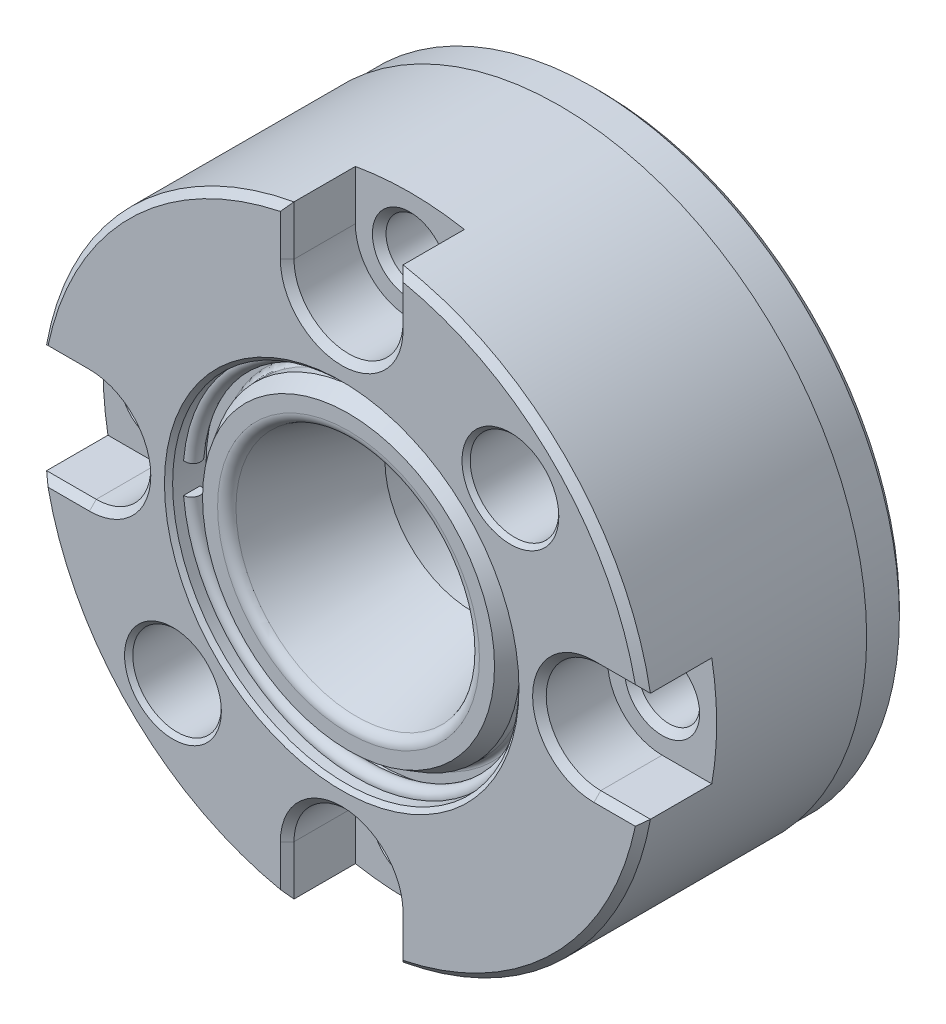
ISO-10303-21;
HEADER;
FILE_DESCRIPTION(('STEP AP214'),'2;1');
FILE_NAME('part.step','',(''),(''),'','','');
FILE_SCHEMA(('AUTOMOTIVE_DESIGN { 1 0 10303 214 1 1 1 1 }'));
ENDSEC;
DATA;
#1=APPLICATION_CONTEXT('core data for automotive mechanical design processes');
#2=APPLICATION_PROTOCOL_DEFINITION('international standard','automotive_design',2000,#1);
#3=PRODUCT_CONTEXT('',#1,'mechanical');
#4=PRODUCT('Part','Part','',(#3));
#5=PRODUCT_RELATED_PRODUCT_CATEGORY('part','',(#4));
#6=PRODUCT_DEFINITION_FORMATION('','',#4);
#7=PRODUCT_DEFINITION_CONTEXT('part definition',#1,'design');
#8=PRODUCT_DEFINITION('design','',#6,#7);
#9=PRODUCT_DEFINITION_SHAPE('','',#8);
#10=(LENGTH_UNIT() NAMED_UNIT(*) SI_UNIT(.MILLI.,.METRE.));
#11=(NAMED_UNIT(*) PLANE_ANGLE_UNIT() SI_UNIT($,.RADIAN.));
#12=(NAMED_UNIT(*) SI_UNIT($,.STERADIAN.) SOLID_ANGLE_UNIT());
#13=UNCERTAINTY_MEASURE_WITH_UNIT(LENGTH_MEASURE(1.E-05),#10,'distance_accuracy_value','');
#14=(GEOMETRIC_REPRESENTATION_CONTEXT(3) GLOBAL_UNCERTAINTY_ASSIGNED_CONTEXT((#13)) GLOBAL_UNIT_ASSIGNED_CONTEXT((#10,
#11,#12)) REPRESENTATION_CONTEXT('',''));
#15=CARTESIAN_POINT('',(0.,0.,0.));
#16=DIRECTION('',(0.,0.,1.));
#17=DIRECTION('',(1.,0.,0.));
#18=AXIS2_PLACEMENT_3D('',#15,#16,#17);
#19=CARTESIAN_POINT('',(-12.7,0.,18.5));
#20=DIRECTION('',(0.,0.,1.));
#21=DIRECTION('',(-1.,0.,0.));
#22=AXIS2_PLACEMENT_3D('',#19,#20,#21);
#23=PLANE('',#22);
#24=CARTESIAN_POINT('',(0.,0.,18.5));
#25=DIRECTION('',(0.,0.,1.));
#26=DIRECTION('',(-1.,0.,0.));
#27=AXIS2_PLACEMENT_3D('',#24,#25,#26);
#28=CIRCLE('',#27,9.60284324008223);
#29=CARTESIAN_POINT('',(-9.60284324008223,0.,18.5));
#30=VERTEX_POINT('',#29);
#31=EDGE_CURVE('E1219',#30,#30,#28,.F.);
#32=ORIENTED_EDGE('',*,*,#31,.T.);
#33=EDGE_LOOP('',(#32));
#34=FACE_BOUND('',#33,.T.);
#35=CARTESIAN_POINT('',(0.,0.,18.5));
#36=DIRECTION('',(0.,0.,1.));
#37=DIRECTION('',(-1.,0.,0.));
#38=AXIS2_PLACEMENT_3D('',#35,#36,#37);
#39=CIRCLE('',#38,10.7071796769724);
#40=CARTESIAN_POINT('',(-10.7071796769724,0.,18.5));
#41=VERTEX_POINT('',#40);
#42=EDGE_CURVE('E1207',#41,#41,#39,.T.);
#43=ORIENTED_EDGE('',*,*,#42,.T.);
#44=EDGE_LOOP('',(#43));
#45=FACE_BOUND('',#44,.T.);
#46=ADVANCED_FACE('F14',(#34,#45),#23,.T.);
#47=CARTESIAN_POINT('',(0.,0.,8.9));
#48=DIRECTION('',(0.,0.,1.));
#49=DIRECTION('',(-1.,0.,0.));
#50=AXIS2_PLACEMENT_3D('',#47,#48,#49);
#51=CONICAL_SURFACE('',#50,6.24724429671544,0.279252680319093);
#52=CARTESIAN_POINT('',(0.,0.,9.43272244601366));
#53=DIRECTION('',(0.,0.,1.));
#54=DIRECTION('',(-1.,0.,0.));
#55=AXIS2_PLACEMENT_3D('',#52,#53,#54);
#56=CIRCLE('',#55,6.4);
#57=CARTESIAN_POINT('',(-6.4,0.,9.43272244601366));
#58=VERTEX_POINT('',#57);
#59=EDGE_CURVE('E1222',#58,#58,#56,.T.);
#60=ORIENTED_EDGE('',*,*,#59,.F.);
#61=EDGE_LOOP('',(#60));
#62=FACE_BOUND('',#61,.T.);
#63=CARTESIAN_POINT('',(0.,0.,17.9205098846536));
#64=DIRECTION('',(0.,0.,-1.));
#65=DIRECTION('',(1.,0.,0.));
#66=AXIS2_PLACEMENT_3D('',#63,#64,#65);
#67=CIRCLE('',#66,8.83383388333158);
#68=CARTESIAN_POINT('',(8.83383388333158,0.,17.9205098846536));
#69=VERTEX_POINT('',#68);
#70=EDGE_CURVE('E1210',#69,#69,#67,.F.);
#71=ORIENTED_EDGE('',*,*,#70,.T.);
#72=EDGE_LOOP('',(#71));
#73=FACE_BOUND('',#72,.T.);
#74=ADVANCED_FACE('F1186',(#62,#73),#51,.F.);
#75=CARTESIAN_POINT('',(0.,0.,18.5));
#76=DIRECTION('',(0.,0.,-1.));
#77=DIRECTION('',(1.,0.,0.));
#78=AXIS2_PLACEMENT_3D('',#75,#76,#77);
#79=CYLINDRICAL_SURFACE('',#78,11.4);
#80=CARTESIAN_POINT('',(0.,0.,16.65));
#81=DIRECTION('',(0.,0.,1.));
#82=DIRECTION('',(-1.,0.,0.));
#83=AXIS2_PLACEMENT_3D('',#80,#81,#82);
#84=CIRCLE('',#83,11.4);
#85=CARTESIAN_POINT('',(-11.4,0.,16.65));
#86=VERTEX_POINT('',#85);
#87=EDGE_CURVE('E1206',#86,#86,#84,.T.);
#88=ORIENTED_EDGE('',*,*,#87,.T.);
#89=EDGE_LOOP('',(#88));
#90=FACE_BOUND('',#89,.T.);
#91=CARTESIAN_POINT('',(0.,0.,17.3));
#92=DIRECTION('',(0.,0.,1.));
#93=DIRECTION('',(-1.,0.,0.));
#94=AXIS2_PLACEMENT_3D('',#91,#92,#93);
#95=CIRCLE('',#94,11.4);
#96=CARTESIAN_POINT('',(-11.4,0.,17.3));
#97=VERTEX_POINT('',#96);
#98=EDGE_CURVE('E1213',#97,#97,#95,.F.);
#99=ORIENTED_EDGE('',*,*,#98,.T.);
#100=EDGE_LOOP('',(#99));
#101=FACE_BOUND('',#100,.T.);
#102=ADVANCED_FACE('F1190',(#90,#101),#79,.T.);
#103=CARTESIAN_POINT('',(-11.4,0.,16.25));
#104=DIRECTION('',(0.,0.,1.));
#105=DIRECTION('',(-1.,0.,0.));
#106=AXIS2_PLACEMENT_3D('',#103,#104,#105);
#107=PLANE('',#106);
#108=CARTESIAN_POINT('',(0.,0.,16.25));
#109=DIRECTION('',(0.,0.,1.));
#110=DIRECTION('',(-1.,0.,0.));
#111=AXIS2_PLACEMENT_3D('',#108,#109,#110);
#112=CIRCLE('',#111,12.7);
#113=CARTESIAN_POINT('',(-12.7,0.,16.25));
#114=VERTEX_POINT('',#113);
#115=EDGE_CURVE('E22',#114,#114,#112,.F.);
#116=ORIENTED_EDGE('',*,*,#115,.F.);
#117=EDGE_LOOP('',(#116));
#118=FACE_BOUND('',#117,.T.);
#119=CARTESIAN_POINT('',(0.,0.,16.25));
#120=DIRECTION('',(0.,0.,1.));
#121=DIRECTION('',(-1.,0.,0.));
#122=AXIS2_PLACEMENT_3D('',#119,#120,#121);
#123=CIRCLE('',#122,11.8);
#124=CARTESIAN_POINT('',(-11.8,0.,16.25));
#125=VERTEX_POINT('',#124);
#126=EDGE_CURVE('E1204',#125,#125,#123,.F.);
#127=ORIENTED_EDGE('',*,*,#126,.T.);
#128=EDGE_LOOP('',(#127));
#129=FACE_BOUND('',#128,.T.);
#130=ADVANCED_FACE('F1182',(#118,#129),#107,.T.);
#131=CARTESIAN_POINT('',(0.,0.,17.3));
#132=DIRECTION('',(0.,0.,-1.));
#133=DIRECTION('',(1.,0.,0.));
#134=AXIS2_PLACEMENT_3D('',#131,#132,#133);
#135=CONICAL_SURFACE('',#134,11.4,0.5235987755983);
#136=ORIENTED_EDGE('',*,*,#42,.F.);
#137=EDGE_LOOP('',(#136));
#138=FACE_BOUND('',#137,.T.);
#139=ORIENTED_EDGE('',*,*,#98,.F.);
#140=EDGE_LOOP('',(#139));
#141=FACE_BOUND('',#140,.T.);
#142=ADVANCED_FACE('F1178',(#138,#141),#135,.T.);
#143=CARTESIAN_POINT('',(0.,0.,16.65));
#144=DIRECTION('',(0.,0.,1.));
#145=DIRECTION('',(-1.,0.,0.));
#146=AXIS2_PLACEMENT_3D('',#143,#144,#145);
#147=TOROIDAL_SURFACE('',#146,11.8,0.4);
#148=ORIENTED_EDGE('',*,*,#87,.F.);
#149=EDGE_LOOP('',(#148));
#150=FACE_BOUND('',#149,.T.);
#151=ORIENTED_EDGE('',*,*,#126,.F.);
#152=EDGE_LOOP('',(#151));
#153=FACE_BOUND('',#152,.T.);
#154=ADVANCED_FACE('F1174',(#150,#153),#147,.F.);
#155=CARTESIAN_POINT('',(0.,0.,17.7));
#156=DIRECTION('',(0.,0.,1.));
#157=DIRECTION('',(-1.,0.,0.));
#158=AXIS2_PLACEMENT_3D('',#155,#156,#157);
#159=TOROIDAL_SURFACE('',#158,9.60284324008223,0.8);
#160=ORIENTED_EDGE('',*,*,#31,.F.);
#161=EDGE_LOOP('',(#160));
#162=FACE_BOUND('',#161,.T.);
#163=ORIENTED_EDGE('',*,*,#70,.F.);
#164=EDGE_LOOP('',(#163));
#165=FACE_BOUND('',#164,.T.);
#166=ADVANCED_FACE('F577',(#162,#165),#159,.T.);
#167=CARTESIAN_POINT('',(0.,0.,18.5));
#168=DIRECTION('',(0.,0.,1.));
#169=DIRECTION('',(-1.,0.,0.));
#170=AXIS2_PLACEMENT_3D('',#167,#168,#169);
#171=CYLINDRICAL_SURFACE('',#170,6.4);
#172=ORIENTED_EDGE('',*,*,#59,.T.);
#173=EDGE_LOOP('',(#172));
#174=FACE_BOUND('',#173,.T.);
#175=CARTESIAN_POINT('',(0.,0.,6.));
#176=DIRECTION('',(0.,0.,-1.));
#177=DIRECTION('',(1.,0.,0.));
#178=AXIS2_PLACEMENT_3D('',#175,#176,#177);
#179=CIRCLE('',#178,6.4);
#180=CARTESIAN_POINT('',(6.4,0.,6.));
#181=VERTEX_POINT('',#180);
#182=EDGE_CURVE('E9',#181,#181,#179,.T.);
#183=ORIENTED_EDGE('',*,*,#182,.T.);
#184=EDGE_LOOP('',(#183));
#185=FACE_BOUND('',#184,.T.);
#186=ADVANCED_FACE('F567',(#174,#185),#171,.F.);
#187=CARTESIAN_POINT('',(-18.5,0.,0.));
#188=DIRECTION('',(0.,0.,-1.));
#189=DIRECTION('',(-1.,0.,0.));
#190=AXIS2_PLACEMENT_3D('',#187,#188,#189);
#191=CONICAL_SURFACE('',#190,2.75,0.785398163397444);
#192=CARTESIAN_POINT('',(-18.5,0.,0.499999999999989));
#193=DIRECTION('',(0.,0.,-1.));
#194=DIRECTION('',(-1.,0.,0.));
#195=AXIS2_PLACEMENT_3D('',#192,#193,#194);
#196=CIRCLE('',#195,2.25);
#197=CARTESIAN_POINT('',(-20.75,0.,0.499999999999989));
#198=VERTEX_POINT('',#197);
#199=EDGE_CURVE('E300',#198,#198,#196,.T.);
#200=ORIENTED_EDGE('',*,*,#199,.F.);
#201=EDGE_LOOP('',(#200));
#202=FACE_BOUND('',#201,.T.);
#203=CARTESIAN_POINT('',(-18.5,0.,0.));
#204=DIRECTION('',(0.,0.,-1.));
#205=DIRECTION('',(-1.,0.,0.));
#206=AXIS2_PLACEMENT_3D('',#203,#204,#205);
#207=CIRCLE('',#206,2.75);
#208=CARTESIAN_POINT('',(-21.25,0.,0.));
#209=VERTEX_POINT('',#208);
#210=EDGE_CURVE('E286',#209,#209,#207,.F.);
#211=ORIENTED_EDGE('',*,*,#210,.F.);
#212=EDGE_LOOP('',(#211));
#213=FACE_BOUND('',#212,.T.);
#214=ADVANCED_FACE('F564',(#202,#213),#191,.F.);
#215=CARTESIAN_POINT('',(0.,-18.5,0.));
#216=DIRECTION('',(0.,0.,-1.));
#217=DIRECTION('',(-1.,0.,0.));
#218=AXIS2_PLACEMENT_3D('',#215,#216,#217);
#219=CONICAL_SURFACE('',#218,2.75,0.785398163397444);
#220=CARTESIAN_POINT('',(0.,-18.5,0.499999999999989));
#221=DIRECTION('',(0.,0.,-1.));
#222=DIRECTION('',(-1.,0.,0.));
#223=AXIS2_PLACEMENT_3D('',#220,#221,#222);
#224=CIRCLE('',#223,2.25);
#225=CARTESIAN_POINT('',(-2.24999999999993,-18.5,0.499999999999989));
#226=VERTEX_POINT('',#225);
#227=EDGE_CURVE('E312',#226,#226,#224,.T.);
#228=ORIENTED_EDGE('',*,*,#227,.F.);
#229=EDGE_LOOP('',(#228));
#230=FACE_BOUND('',#229,.T.);
#231=CARTESIAN_POINT('',(0.,-18.5,0.));
#232=DIRECTION('',(0.,0.,-1.));
#233=DIRECTION('',(-1.,0.,0.));
#234=AXIS2_PLACEMENT_3D('',#231,#232,#233);
#235=CIRCLE('',#234,2.75);
#236=CARTESIAN_POINT('',(-2.74999999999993,-18.5,0.));
#237=VERTEX_POINT('',#236);
#238=EDGE_CURVE('E306',#237,#237,#235,.F.);
#239=ORIENTED_EDGE('',*,*,#238,.F.);
#240=EDGE_LOOP('',(#239));
#241=FACE_BOUND('',#240,.T.);
#242=ADVANCED_FACE('F566',(#230,#241),#219,.F.);
#243=CARTESIAN_POINT('',(18.5,1.31450406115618E-13,0.));
#244=DIRECTION('',(0.,0.,-1.));
#245=DIRECTION('',(-1.,0.,0.));
#246=AXIS2_PLACEMENT_3D('',#243,#244,#245);
#247=CONICAL_SURFACE('',#246,2.75,0.785398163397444);
#248=CARTESIAN_POINT('',(18.5,1.31450406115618E-13,0.499999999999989));
#249=DIRECTION('',(0.,0.,-1.));
#250=DIRECTION('',(-1.,0.,0.));
#251=AXIS2_PLACEMENT_3D('',#248,#249,#250);
#252=CIRCLE('',#251,2.25);
#253=CARTESIAN_POINT('',(16.25,1.31450406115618E-13,0.499999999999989));
#254=VERTEX_POINT('',#253);
#255=EDGE_CURVE('E324',#254,#254,#252,.T.);
#256=ORIENTED_EDGE('',*,*,#255,.F.);
#257=EDGE_LOOP('',(#256));
#258=FACE_BOUND('',#257,.T.);
#259=CARTESIAN_POINT('',(18.5,1.31450406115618E-13,0.));
#260=DIRECTION('',(0.,0.,-1.));
#261=DIRECTION('',(-1.,0.,0.));
#262=AXIS2_PLACEMENT_3D('',#259,#260,#261);
#263=CIRCLE('',#262,2.75);
#264=CARTESIAN_POINT('',(15.75,1.31450406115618E-13,0.));
#265=VERTEX_POINT('',#264);
#266=EDGE_CURVE('E318',#265,#265,#263,.F.);
#267=ORIENTED_EDGE('',*,*,#266,.F.);
#268=EDGE_LOOP('',(#267));
#269=FACE_BOUND('',#268,.T.);
#270=ADVANCED_FACE('F574',(#258,#269),#247,.F.);
#271=CARTESIAN_POINT('',(-1.96042810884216E-13,18.5,0.));
#272=DIRECTION('',(0.,0.,-1.));
#273=DIRECTION('',(-1.,0.,0.));
#274=AXIS2_PLACEMENT_3D('',#271,#272,#273);
#275=CONICAL_SURFACE('',#274,2.75,0.785398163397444);
#276=CARTESIAN_POINT('',(-1.96041753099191E-13,18.5,0.499999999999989));
#277=DIRECTION('',(0.,0.,-1.));
#278=DIRECTION('',(-1.,0.,0.));
#279=AXIS2_PLACEMENT_3D('',#276,#277,#278);
#280=CIRCLE('',#279,2.25);
#281=CARTESIAN_POINT('',(-2.2500000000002,18.5,0.499999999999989));
#282=VERTEX_POINT('',#281);
#283=EDGE_CURVE('E336',#282,#282,#280,.T.);
#284=ORIENTED_EDGE('',*,*,#283,.F.);
#285=EDGE_LOOP('',(#284));
#286=FACE_BOUND('',#285,.T.);
#287=CARTESIAN_POINT('',(-1.96042810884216E-13,18.5,0.));
#288=DIRECTION('',(0.,0.,-1.));
#289=DIRECTION('',(-1.,0.,0.));
#290=AXIS2_PLACEMENT_3D('',#287,#288,#289);
#291=CIRCLE('',#290,2.75);
#292=CARTESIAN_POINT('',(-2.7500000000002,18.5,0.));
#293=VERTEX_POINT('',#292);
#294=EDGE_CURVE('E330',#293,#293,#291,.F.);
#295=ORIENTED_EDGE('',*,*,#294,.F.);
#296=EDGE_LOOP('',(#295));
#297=FACE_BOUND('',#296,.T.);
#298=ADVANCED_FACE('F597',(#286,#297),#275,.F.);
#299=CARTESIAN_POINT('',(-22.5,0.,0.));
#300=DIRECTION('',(0.,0.,-1.));
#301=DIRECTION('',(-1.,0.,0.));
#302=AXIS2_PLACEMENT_3D('',#299,#300,#301);
#303=PLANE('',#302);
#304=CARTESIAN_POINT('',(12.3743686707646,12.3743686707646,0.));
#305=DIRECTION('',(0.,0.,1.));
#306=DIRECTION('',(1.,0.,0.));
#307=AXIS2_PLACEMENT_3D('',#304,#305,#306);
#308=CIRCLE('',#307,3.5);
#309=CARTESIAN_POINT('',(15.8743686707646,12.3743686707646,0.));
#310=VERTEX_POINT('',#309);
#311=EDGE_CURVE('E1238',#310,#310,#308,.T.);
#312=ORIENTED_EDGE('',*,*,#311,.T.);
#313=EDGE_LOOP('',(#312));
#314=FACE_BOUND('',#313,.T.);
#315=CARTESIAN_POINT('',(-12.3743686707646,-12.3743686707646,0.));
#316=DIRECTION('',(0.,0.,1.));
#317=DIRECTION('',(1.,0.,0.));
#318=AXIS2_PLACEMENT_3D('',#315,#316,#317);
#319=CIRCLE('',#318,3.5);
#320=CARTESIAN_POINT('',(-8.8743686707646,-12.3743686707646,0.));
#321=VERTEX_POINT('',#320);
#322=EDGE_CURVE('E419',#321,#321,#319,.T.);
#323=ORIENTED_EDGE('',*,*,#322,.T.);
#324=EDGE_LOOP('',(#323));
#325=FACE_BOUND('',#324,.T.);
#326=CARTESIAN_POINT('',(0.,0.,0.));
#327=DIRECTION('',(0.,0.,-1.));
#328=DIRECTION('',(-1.,0.,0.));
#329=AXIS2_PLACEMENT_3D('',#326,#327,#328);
#330=CIRCLE('',#329,9.06111367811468);
#331=CARTESIAN_POINT('',(-9.06111367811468,0.,0.));
#332=VERTEX_POINT('',#331);
#333=EDGE_CURVE('E1436',#332,#332,#330,.F.);
#334=ORIENTED_EDGE('',*,*,#333,.T.);
#335=EDGE_LOOP('',(#334));
#336=FACE_BOUND('',#335,.T.);
#337=CARTESIAN_POINT('',(0.,0.,0.));
#338=DIRECTION('',(0.,0.,-1.));
#339=DIRECTION('',(-1.,0.,0.));
#340=AXIS2_PLACEMENT_3D('',#337,#338,#339);
#341=CIRCLE('',#340,21.9);
#342=CARTESIAN_POINT('',(-21.9,0.,0.));
#343=VERTEX_POINT('',#342);
#344=EDGE_CURVE('E427',#343,#343,#341,.T.);
#345=ORIENTED_EDGE('',*,*,#344,.T.);
#346=EDGE_LOOP('',(#345));
#347=FACE_BOUND('',#346,.T.);
#348=ORIENTED_EDGE('',*,*,#294,.T.);
#349=EDGE_LOOP('',(#348));
#350=FACE_BOUND('',#349,.T.);
#351=ORIENTED_EDGE('',*,*,#266,.T.);
#352=EDGE_LOOP('',(#351));
#353=FACE_BOUND('',#352,.T.);
#354=ORIENTED_EDGE('',*,*,#238,.T.);
#355=EDGE_LOOP('',(#354));
#356=FACE_BOUND('',#355,.T.);
#357=ORIENTED_EDGE('',*,*,#210,.T.);
#358=EDGE_LOOP('',(#357));
#359=FACE_BOUND('',#358,.T.);
#360=ADVANCED_FACE('F605',(#314,#325,#336,#347,#350,#353,#356,#359),#303,.T.);
#361=CARTESIAN_POINT('',(-18.5,0.,0.));
#362=DIRECTION('',(0.,0.,1.));
#363=DIRECTION('',(1.,0.,0.));
#364=AXIS2_PLACEMENT_3D('',#361,#362,#363);
#365=CYLINDRICAL_SURFACE('',#364,2.25);
#366=ORIENTED_EDGE('',*,*,#199,.T.);
#367=EDGE_LOOP('',(#366));
#368=FACE_BOUND('',#367,.T.);
#369=CARTESIAN_POINT('',(-18.5,0.,13.5));
#370=DIRECTION('',(0.,0.,1.));
#371=DIRECTION('',(1.,0.,0.));
#372=AXIS2_PLACEMENT_3D('',#369,#370,#371);
#373=CIRCLE('',#372,2.25);
#374=CARTESIAN_POINT('',(-16.25,0.,13.5));
#375=VERTEX_POINT('',#374);
#376=EDGE_CURVE('E297',#375,#375,#373,.T.);
#377=ORIENTED_EDGE('',*,*,#376,.T.);
#378=EDGE_LOOP('',(#377));
#379=FACE_BOUND('',#378,.T.);
#380=ADVANCED_FACE('F763',(#368,#379),#365,.F.);
#381=CARTESIAN_POINT('',(0.,-18.5,0.));
#382=DIRECTION('',(0.,0.,1.));
#383=DIRECTION('',(1.,0.,0.));
#384=AXIS2_PLACEMENT_3D('',#381,#382,#383);
#385=CYLINDRICAL_SURFACE('',#384,2.25);
#386=ORIENTED_EDGE('',*,*,#227,.T.);
#387=EDGE_LOOP('',(#386));
#388=FACE_BOUND('',#387,.T.);
#389=CARTESIAN_POINT('',(0.,-18.5,13.5));
#390=DIRECTION('',(0.,0.,1.));
#391=DIRECTION('',(1.,0.,0.));
#392=AXIS2_PLACEMENT_3D('',#389,#390,#391);
#393=CIRCLE('',#392,2.25);
#394=CARTESIAN_POINT('',(2.25000000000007,-18.5,13.5));
#395=VERTEX_POINT('',#394);
#396=EDGE_CURVE('E309',#395,#395,#393,.T.);
#397=ORIENTED_EDGE('',*,*,#396,.T.);
#398=EDGE_LOOP('',(#397));
#399=FACE_BOUND('',#398,.T.);
#400=ADVANCED_FACE('F766',(#388,#399),#385,.F.);
#401=CARTESIAN_POINT('',(18.5,1.31450406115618E-13,0.));
#402=DIRECTION('',(0.,0.,1.));
#403=DIRECTION('',(1.,0.,0.));
#404=AXIS2_PLACEMENT_3D('',#401,#402,#403);
#405=CYLINDRICAL_SURFACE('',#404,2.25);
#406=ORIENTED_EDGE('',*,*,#255,.T.);
#407=EDGE_LOOP('',(#406));
#408=FACE_BOUND('',#407,.T.);
#409=CARTESIAN_POINT('',(18.5,1.31450406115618E-13,13.5));
#410=DIRECTION('',(0.,0.,1.));
#411=DIRECTION('',(1.,0.,0.));
#412=AXIS2_PLACEMENT_3D('',#409,#410,#411);
#413=CIRCLE('',#412,2.25);
#414=CARTESIAN_POINT('',(20.75,1.31450406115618E-13,13.5));
#415=VERTEX_POINT('',#414);
#416=EDGE_CURVE('E321',#415,#415,#413,.T.);
#417=ORIENTED_EDGE('',*,*,#416,.T.);
#418=EDGE_LOOP('',(#417));
#419=FACE_BOUND('',#418,.T.);
#420=ADVANCED_FACE('F818',(#408,#419),#405,.F.);
#421=CARTESIAN_POINT('',(0.,0.,0.));
#422=DIRECTION('',(0.,0.,1.));
#423=DIRECTION('',(1.,0.,0.));
#424=AXIS2_PLACEMENT_3D('',#421,#422,#423);
#425=CONICAL_SURFACE('',#424,21.9,0.785398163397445);
#426=CARTESIAN_POINT('',(0.,0.,0.5));
#427=DIRECTION('',(0.,0.,-1.));
#428=DIRECTION('',(-1.,0.,0.));
#429=AXIS2_PLACEMENT_3D('',#426,#427,#428);
#430=CIRCLE('',#429,22.4);
#431=CARTESIAN_POINT('',(-22.4,0.,0.500000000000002));
#432=VERTEX_POINT('',#431);
#433=EDGE_CURVE('E430',#432,#432,#430,.F.);
#434=ORIENTED_EDGE('',*,*,#433,.F.);
#435=EDGE_LOOP('',(#434));
#436=FACE_BOUND('',#435,.T.);
#437=ORIENTED_EDGE('',*,*,#344,.F.);
#438=EDGE_LOOP('',(#437));
#439=FACE_BOUND('',#438,.T.);
#440=ADVANCED_FACE('F466',(#436,#439),#425,.T.);
#441=CARTESIAN_POINT('',(-1.96042810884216E-13,18.5,0.));
#442=DIRECTION('',(0.,0.,1.));
#443=DIRECTION('',(1.,0.,0.));
#444=AXIS2_PLACEMENT_3D('',#441,#442,#443);
#445=CYLINDRICAL_SURFACE('',#444,2.25);
#446=ORIENTED_EDGE('',*,*,#283,.T.);
#447=EDGE_LOOP('',(#446));
#448=FACE_BOUND('',#447,.T.);
#449=CARTESIAN_POINT('',(-1.96014250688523E-13,18.5,13.5));
#450=DIRECTION('',(0.,0.,1.));
#451=DIRECTION('',(1.,0.,0.));
#452=AXIS2_PLACEMENT_3D('',#449,#450,#451);
#453=CIRCLE('',#452,2.25);
#454=CARTESIAN_POINT('',(2.2499999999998,18.5,13.5));
#455=VERTEX_POINT('',#454);
#456=EDGE_CURVE('E333',#455,#455,#453,.T.);
#457=ORIENTED_EDGE('',*,*,#456,.T.);
#458=EDGE_LOOP('',(#457));
#459=FACE_BOUND('',#458,.T.);
#460=ADVANCED_FACE('F813',(#448,#459),#445,.F.);
#461=CARTESIAN_POINT('',(12.3743686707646,12.3743686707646,1.));
#462=DIRECTION('',(0.,0.,-1.));
#463=DIRECTION('',(-1.,0.,0.));
#464=AXIS2_PLACEMENT_3D('',#461,#462,#463);
#465=CONICAL_SURFACE('',#464,2.5,0.785398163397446);
#466=CARTESIAN_POINT('',(12.3743686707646,12.3743686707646,0.5));
#467=DIRECTION('',(0.,0.,-1.));
#468=DIRECTION('',(-1.,0.,0.));
#469=AXIS2_PLACEMENT_3D('',#466,#467,#468);
#470=CIRCLE('',#469,3.);
#471=CARTESIAN_POINT('',(9.3743686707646,12.3743686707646,0.5));
#472=VERTEX_POINT('',#471);
#473=EDGE_CURVE('E1232',#472,#472,#470,.F.);
#474=ORIENTED_EDGE('',*,*,#473,.T.);
#475=EDGE_LOOP('',(#474));
#476=FACE_BOUND('',#475,.T.);
#477=ORIENTED_EDGE('',*,*,#311,.F.);
#478=EDGE_LOOP('',(#477));
#479=FACE_BOUND('',#478,.T.);
#480=ADVANCED_FACE('F816',(#476,#479),#465,.F.);
#481=CARTESIAN_POINT('',(-12.3743686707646,-12.3743686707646,1.));
#482=DIRECTION('',(0.,0.,-1.));
#483=DIRECTION('',(-1.,0.,0.));
#484=AXIS2_PLACEMENT_3D('',#481,#482,#483);
#485=CONICAL_SURFACE('',#484,2.5,0.785398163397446);
#486=CARTESIAN_POINT('',(-12.3743686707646,-12.3743686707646,0.5));
#487=DIRECTION('',(0.,0.,-1.));
#488=DIRECTION('',(-1.,0.,0.));
#489=AXIS2_PLACEMENT_3D('',#486,#487,#488);
#490=CIRCLE('',#489,3.);
#491=CARTESIAN_POINT('',(-15.3743686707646,-12.3743686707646,0.5));
#492=VERTEX_POINT('',#491);
#493=EDGE_CURVE('E1227',#492,#492,#490,.F.);
#494=ORIENTED_EDGE('',*,*,#493,.T.);
#495=EDGE_LOOP('',(#494));
#496=FACE_BOUND('',#495,.T.);
#497=ORIENTED_EDGE('',*,*,#322,.F.);
#498=EDGE_LOOP('',(#497));
#499=FACE_BOUND('',#498,.T.);
#500=ADVANCED_FACE('F588',(#496,#499),#485,.F.);
#501=CARTESIAN_POINT('',(-18.5,0.,13.5));
#502=DIRECTION('',(0.,0.,1.));
#503=DIRECTION('',(1.,0.,0.));
#504=AXIS2_PLACEMENT_3D('',#501,#502,#503);
#505=CONICAL_SURFACE('',#504,2.25,0.785398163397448);
#506=CARTESIAN_POINT('',(-18.5,0.,14.));
#507=DIRECTION('',(0.,0.,1.));
#508=DIRECTION('',(1.,0.,0.));
#509=AXIS2_PLACEMENT_3D('',#506,#507,#508);
#510=CIRCLE('',#509,2.75);
#511=CARTESIAN_POINT('',(-15.75,0.,14.));
#512=VERTEX_POINT('',#511);
#513=EDGE_CURVE('E303',#512,#512,#510,.F.);
#514=ORIENTED_EDGE('',*,*,#513,.F.);
#515=EDGE_LOOP('',(#514));
#516=FACE_BOUND('',#515,.T.);
#517=ORIENTED_EDGE('',*,*,#376,.F.);
#518=EDGE_LOOP('',(#517));
#519=FACE_BOUND('',#518,.T.);
#520=ADVANCED_FACE('F585',(#516,#519),#505,.F.);
#521=CARTESIAN_POINT('',(0.,-18.5,13.5));
#522=DIRECTION('',(0.,0.,1.));
#523=DIRECTION('',(1.,0.,0.));
#524=AXIS2_PLACEMENT_3D('',#521,#522,#523);
#525=CONICAL_SURFACE('',#524,2.25,0.785398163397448);
#526=CARTESIAN_POINT('',(0.,-18.5,14.));
#527=DIRECTION('',(0.,0.,1.));
#528=DIRECTION('',(1.,0.,0.));
#529=AXIS2_PLACEMENT_3D('',#526,#527,#528);
#530=CIRCLE('',#529,2.75);
#531=CARTESIAN_POINT('',(2.75000000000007,-18.5,14.));
#532=VERTEX_POINT('',#531);
#533=EDGE_CURVE('E315',#532,#532,#530,.F.);
#534=ORIENTED_EDGE('',*,*,#533,.F.);
#535=EDGE_LOOP('',(#534));
#536=FACE_BOUND('',#535,.T.);
#537=ORIENTED_EDGE('',*,*,#396,.F.);
#538=EDGE_LOOP('',(#537));
#539=FACE_BOUND('',#538,.T.);
#540=ADVANCED_FACE('F587',(#536,#539),#525,.F.);
#541=CARTESIAN_POINT('',(18.5,1.31450406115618E-13,13.5));
#542=DIRECTION('',(0.,0.,1.));
#543=DIRECTION('',(1.,0.,0.));
#544=AXIS2_PLACEMENT_3D('',#541,#542,#543);
#545=CONICAL_SURFACE('',#544,2.25,0.785398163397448);
#546=CARTESIAN_POINT('',(18.5,1.31450406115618E-13,14.));
#547=DIRECTION('',(0.,0.,1.));
#548=DIRECTION('',(1.,0.,0.));
#549=AXIS2_PLACEMENT_3D('',#546,#547,#548);
#550=CIRCLE('',#549,2.75);
#551=CARTESIAN_POINT('',(21.25,1.31450406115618E-13,14.));
#552=VERTEX_POINT('',#551);
#553=EDGE_CURVE('E327',#552,#552,#550,.F.);
#554=ORIENTED_EDGE('',*,*,#553,.F.);
#555=EDGE_LOOP('',(#554));
#556=FACE_BOUND('',#555,.T.);
#557=ORIENTED_EDGE('',*,*,#416,.F.);
#558=EDGE_LOOP('',(#557));
#559=FACE_BOUND('',#558,.T.);
#560=ADVANCED_FACE('F593',(#556,#559),#545,.F.);
#561=CARTESIAN_POINT('',(0.,0.,0.));
#562=DIRECTION('',(0.,0.,-1.));
#563=DIRECTION('',(-1.,0.,0.));
#564=AXIS2_PLACEMENT_3D('',#561,#562,#563);
#565=CYLINDRICAL_SURFACE('',#564,22.4);
#566=ORIENTED_EDGE('',*,*,#433,.T.);
#567=EDGE_LOOP('',(#566));
#568=FACE_BOUND('',#567,.T.);
#569=CARTESIAN_POINT('',(0.,0.,3.));
#570=DIRECTION('',(0.,0.,-1.));
#571=DIRECTION('',(-1.,0.,0.));
#572=AXIS2_PLACEMENT_3D('',#569,#570,#571);
#573=CIRCLE('',#572,22.4);
#574=CARTESIAN_POINT('',(-22.4,0.,3.));
#575=VERTEX_POINT('',#574);
#576=EDGE_CURVE('E216',#575,#575,#573,.T.);
#577=ORIENTED_EDGE('',*,*,#576,.T.);
#578=EDGE_LOOP('',(#577));
#579=FACE_BOUND('',#578,.T.);
#580=ADVANCED_FACE('F601',(#568,#579),#565,.T.);
#581=CARTESIAN_POINT('',(-1.96014250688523E-13,18.5,13.5));
#582=DIRECTION('',(0.,0.,1.));
#583=DIRECTION('',(1.,0.,0.));
#584=AXIS2_PLACEMENT_3D('',#581,#582,#583);
#585=CONICAL_SURFACE('',#584,2.25,0.785398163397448);
#586=CARTESIAN_POINT('',(-1.96013192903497E-13,18.5,14.));
#587=DIRECTION('',(0.,0.,1.));
#588=DIRECTION('',(1.,0.,0.));
#589=AXIS2_PLACEMENT_3D('',#586,#587,#588);
#590=CIRCLE('',#589,2.75);
#591=CARTESIAN_POINT('',(2.7499999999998,18.5,14.));
#592=VERTEX_POINT('',#591);
#593=EDGE_CURVE('E339',#592,#592,#590,.F.);
#594=ORIENTED_EDGE('',*,*,#593,.F.);
#595=EDGE_LOOP('',(#594));
#596=FACE_BOUND('',#595,.T.);
#597=ORIENTED_EDGE('',*,*,#456,.F.);
#598=EDGE_LOOP('',(#597));
#599=FACE_BOUND('',#598,.T.);
#600=ADVANCED_FACE('F607',(#596,#599),#585,.F.);
#601=CARTESIAN_POINT('',(12.3743686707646,12.3743686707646,19.));
#602=DIRECTION('',(0.,0.,-1.));
#603=DIRECTION('',(-1.,0.,0.));
#604=AXIS2_PLACEMENT_3D('',#601,#602,#603);
#605=CYLINDRICAL_SURFACE('',#604,3.);
#606=CARTESIAN_POINT('',(12.3743686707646,12.3743686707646,12.8556624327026));
#607=DIRECTION('',(0.,0.,1.));
#608=DIRECTION('',(1.,0.,0.));
#609=AXIS2_PLACEMENT_3D('',#606,#607,#608);
#610=CIRCLE('',#609,3.);
#611=CARTESIAN_POINT('',(15.3743686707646,12.3743686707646,12.8556624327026));
#612=VERTEX_POINT('',#611);
#613=EDGE_CURVE('E1230',#612,#612,#610,.F.);
#614=ORIENTED_EDGE('',*,*,#613,.F.);
#615=EDGE_LOOP('',(#614));
#616=FACE_BOUND('',#615,.T.);
#617=ORIENTED_EDGE('',*,*,#473,.F.);
#618=EDGE_LOOP('',(#617));
#619=FACE_BOUND('',#618,.T.);
#620=ADVANCED_FACE('F609',(#616,#619),#605,.F.);
#621=CARTESIAN_POINT('',(-12.3743686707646,-12.3743686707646,19.));
#622=DIRECTION('',(0.,0.,-1.));
#623=DIRECTION('',(-1.,0.,0.));
#624=AXIS2_PLACEMENT_3D('',#621,#622,#623);
#625=CYLINDRICAL_SURFACE('',#624,3.);
#626=CARTESIAN_POINT('',(-12.3743686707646,-12.3743686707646,12.8556624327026));
#627=DIRECTION('',(0.,0.,1.));
#628=DIRECTION('',(1.,0.,0.));
#629=AXIS2_PLACEMENT_3D('',#626,#627,#628);
#630=CIRCLE('',#629,3.);
#631=CARTESIAN_POINT('',(-9.3743686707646,-12.3743686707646,12.8556624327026));
#632=VERTEX_POINT('',#631);
#633=EDGE_CURVE('E1231',#632,#632,#630,.F.);
#634=ORIENTED_EDGE('',*,*,#633,.F.);
#635=EDGE_LOOP('',(#634));
#636=FACE_BOUND('',#635,.T.);
#637=ORIENTED_EDGE('',*,*,#493,.F.);
#638=EDGE_LOOP('',(#637));
#639=FACE_BOUND('',#638,.T.);
#640=ADVANCED_FACE('F770',(#636,#639),#625,.F.);
#641=CARTESIAN_POINT('',(-18.5,0.,14.));
#642=DIRECTION('',(0.,0.,1.));
#643=DIRECTION('',(1.,0.,0.));
#644=AXIS2_PLACEMENT_3D('',#641,#642,#643);
#645=PLANE('',#644);
#646=ORIENTED_EDGE('',*,*,#513,.T.);
#647=EDGE_LOOP('',(#646));
#648=FACE_BOUND('',#647,.T.);
#649=CARTESIAN_POINT('',(-18.5,0.,14.));
#650=DIRECTION('',(0.,0.,1.));
#651=DIRECTION('',(1.,0.,0.));
#652=AXIS2_PLACEMENT_3D('',#649,#650,#651);
#653=CIRCLE('',#652,4.);
#654=CARTESIAN_POINT('',(-18.5,-4.,14.));
#655=VERTEX_POINT('',#654);
#656=CARTESIAN_POINT('',(-18.5,4.,14.));
#657=VERTEX_POINT('',#656);
#658=EDGE_CURVE('E264',#655,#657,#653,.T.);
#659=ORIENTED_EDGE('',*,*,#658,.T.);
#660=DIRECTION('',(-1.,0.,0.));
#661=VECTOR('',#660,1.);
#662=CARTESIAN_POINT('',(-18.5,4.,14.));
#663=LINE('',#662,#661);
#664=CARTESIAN_POINT('',(-22.1415898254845,4.,14.));
#665=VERTEX_POINT('',#664);
#666=EDGE_CURVE('E275',#657,#665,#663,.T.);
#667=ORIENTED_EDGE('',*,*,#666,.T.);
#668=CARTESIAN_POINT('',(0.,0.,14.));
#669=DIRECTION('',(0.,0.,1.));
#670=DIRECTION('',(1.,0.,0.));
#671=AXIS2_PLACEMENT_3D('',#668,#669,#670);
#672=CIRCLE('',#671,22.5);
#673=CARTESIAN_POINT('',(-22.1415898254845,-4.,14.));
#674=VERTEX_POINT('',#673);
#675=EDGE_CURVE('E277',#665,#674,#672,.T.);
#676=ORIENTED_EDGE('',*,*,#675,.T.);
#677=DIRECTION('',(1.,0.,0.));
#678=VECTOR('',#677,1.);
#679=CARTESIAN_POINT('',(-18.5,-4.,14.));
#680=LINE('',#679,#678);
#681=EDGE_CURVE('E279',#674,#655,#680,.T.);
#682=ORIENTED_EDGE('',*,*,#681,.T.);
#683=EDGE_LOOP('',(#659,#667,#676,#682));
#684=FACE_BOUND('',#683,.T.);
#685=ADVANCED_FACE('F631',(#648,#684),#645,.T.);
#686=CARTESIAN_POINT('',(0.,-18.5,14.));
#687=DIRECTION('',(0.,0.,1.));
#688=DIRECTION('',(0.,1.,0.));
#689=AXIS2_PLACEMENT_3D('',#686,#687,#688);
#690=PLANE('',#689);
#691=ORIENTED_EDGE('',*,*,#533,.T.);
#692=EDGE_LOOP('',(#691));
#693=FACE_BOUND('',#692,.T.);
#694=CARTESIAN_POINT('',(0.,-18.5,14.));
#695=DIRECTION('',(0.,0.,1.));
#696=DIRECTION('',(0.,1.,0.));
#697=AXIS2_PLACEMENT_3D('',#694,#695,#696);
#698=CIRCLE('',#697,4.);
#699=CARTESIAN_POINT('',(4.00000000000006,-18.5,14.));
#700=VERTEX_POINT('',#699);
#701=CARTESIAN_POINT('',(-3.99999999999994,-18.5,14.));
#702=VERTEX_POINT('',#701);
#703=EDGE_CURVE('E242',#700,#702,#698,.T.);
#704=ORIENTED_EDGE('',*,*,#703,.T.);
#705=DIRECTION('',(0.,-1.,0.));
#706=VECTOR('',#705,1.);
#707=CARTESIAN_POINT('',(-3.99999999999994,-18.5,14.));
#708=LINE('',#707,#706);
#709=CARTESIAN_POINT('',(-3.99999999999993,-22.1415898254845,14.));
#710=VERTEX_POINT('',#709);
#711=EDGE_CURVE('E253',#702,#710,#708,.T.);
#712=ORIENTED_EDGE('',*,*,#711,.T.);
#713=CARTESIAN_POINT('',(0.,0.,14.));
#714=DIRECTION('',(0.,0.,1.));
#715=DIRECTION('',(0.,1.,0.));
#716=AXIS2_PLACEMENT_3D('',#713,#714,#715);
#717=CIRCLE('',#716,22.5);
#718=CARTESIAN_POINT('',(4.00000000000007,-22.1415898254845,14.));
#719=VERTEX_POINT('',#718);
#720=EDGE_CURVE('E255',#710,#719,#717,.T.);
#721=ORIENTED_EDGE('',*,*,#720,.T.);
#722=DIRECTION('',(0.,1.,0.));
#723=VECTOR('',#722,1.);
#724=CARTESIAN_POINT('',(4.00000000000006,-18.5,14.));
#725=LINE('',#724,#723);
#726=EDGE_CURVE('E257',#719,#700,#725,.T.);
#727=ORIENTED_EDGE('',*,*,#726,.T.);
#728=EDGE_LOOP('',(#704,#712,#721,#727));
#729=FACE_BOUND('',#728,.T.);
#730=ADVANCED_FACE('F747',(#693,#729),#690,.T.);
#731=CARTESIAN_POINT('',(18.5,1.31450406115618E-13,14.));
#732=DIRECTION('',(0.,0.,1.));
#733=DIRECTION('',(-1.,0.,0.));
#734=AXIS2_PLACEMENT_3D('',#731,#732,#733);
#735=PLANE('',#734);
#736=ORIENTED_EDGE('',*,*,#553,.T.);
#737=EDGE_LOOP('',(#736));
#738=FACE_BOUND('',#737,.T.);
#739=CARTESIAN_POINT('',(18.5,1.31450406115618E-13,14.));
#740=DIRECTION('',(0.,0.,1.));
#741=DIRECTION('',(-1.,0.,0.));
#742=AXIS2_PLACEMENT_3D('',#739,#740,#741);
#743=CIRCLE('',#742,4.);
#744=CARTESIAN_POINT('',(18.5,4.00000000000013,14.));
#745=VERTEX_POINT('',#744);
#746=CARTESIAN_POINT('',(18.5,-3.99999999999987,14.));
#747=VERTEX_POINT('',#746);
#748=EDGE_CURVE('E224',#745,#747,#743,.T.);
#749=ORIENTED_EDGE('',*,*,#748,.T.);
#750=DIRECTION('',(1.,0.,0.));
#751=VECTOR('',#750,1.);
#752=CARTESIAN_POINT('',(18.5,-3.99999999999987,14.));
#753=LINE('',#752,#751);
#754=CARTESIAN_POINT('',(22.1415898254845,-3.99999999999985,14.));
#755=VERTEX_POINT('',#754);
#756=EDGE_CURVE('E231',#747,#755,#753,.T.);
#757=ORIENTED_EDGE('',*,*,#756,.T.);
#758=CARTESIAN_POINT('',(0.,0.,14.));
#759=DIRECTION('',(0.,0.,1.));
#760=DIRECTION('',(-1.,0.,0.));
#761=AXIS2_PLACEMENT_3D('',#758,#759,#760);
#762=CIRCLE('',#761,22.5);
#763=CARTESIAN_POINT('',(22.1415898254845,4.00000000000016,14.));
#764=VERTEX_POINT('',#763);
#765=EDGE_CURVE('E233',#755,#764,#762,.T.);
#766=ORIENTED_EDGE('',*,*,#765,.T.);
#767=DIRECTION('',(-1.,0.,0.));
#768=VECTOR('',#767,1.);
#769=CARTESIAN_POINT('',(18.5,4.00000000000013,14.));
#770=LINE('',#769,#768);
#771=EDGE_CURVE('E235',#764,#745,#770,.T.);
#772=ORIENTED_EDGE('',*,*,#771,.T.);
#773=EDGE_LOOP('',(#749,#757,#766,#772));
#774=FACE_BOUND('',#773,.T.);
#775=ADVANCED_FACE('F688',(#738,#774),#735,.T.);
#776=CARTESIAN_POINT('',(-22.5,0.,3.));
#777=DIRECTION('',(0.,0.,1.));
#778=DIRECTION('',(1.,0.,0.));
#779=AXIS2_PLACEMENT_3D('',#776,#777,#778);
#780=PLANE('',#779);
#781=ORIENTED_EDGE('',*,*,#576,.F.);
#782=EDGE_LOOP('',(#781));
#783=FACE_BOUND('',#782,.T.);
#784=CARTESIAN_POINT('',(0.,0.,3.));
#785=DIRECTION('',(0.,0.,-1.));
#786=DIRECTION('',(-1.,0.,0.));
#787=AXIS2_PLACEMENT_3D('',#784,#785,#786);
#788=CIRCLE('',#787,22.5);
#789=CARTESIAN_POINT('',(-22.5,0.,3.));
#790=VERTEX_POINT('',#789);
#791=EDGE_CURVE('E213',#790,#790,#788,.T.);
#792=ORIENTED_EDGE('',*,*,#791,.T.);
#793=EDGE_LOOP('',(#792));
#794=FACE_BOUND('',#793,.T.);
#795=ADVANCED_FACE('F793',(#783,#794),#780,.F.);
#796=CARTESIAN_POINT('',(-1.96013192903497E-13,18.5,14.));
#797=DIRECTION('',(0.,0.,1.));
#798=DIRECTION('',(0.,-1.,0.));
#799=AXIS2_PLACEMENT_3D('',#796,#797,#798);
#800=PLANE('',#799);
#801=ORIENTED_EDGE('',*,*,#593,.T.);
#802=EDGE_LOOP('',(#801));
#803=FACE_BOUND('',#802,.T.);
#804=CARTESIAN_POINT('',(-1.96013192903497E-13,18.5,14.));
#805=DIRECTION('',(0.,0.,1.));
#806=DIRECTION('',(0.,-1.,0.));
#807=AXIS2_PLACEMENT_3D('',#804,#805,#806);
#808=CIRCLE('',#807,4.);
#809=CARTESIAN_POINT('',(-4.0000000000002,18.5,14.));
#810=VERTEX_POINT('',#809);
#811=CARTESIAN_POINT('',(3.99999999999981,18.5,14.));
#812=VERTEX_POINT('',#811);
#813=EDGE_CURVE('E193',#810,#812,#808,.T.);
#814=ORIENTED_EDGE('',*,*,#813,.T.);
#815=DIRECTION('',(0.,1.,0.));
#816=VECTOR('',#815,1.);
#817=CARTESIAN_POINT('',(3.99999999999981,18.5,14.));
#818=LINE('',#817,#816);
#819=CARTESIAN_POINT('',(3.99999999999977,22.1415898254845,14.));
#820=VERTEX_POINT('',#819);
#821=EDGE_CURVE('E204',#812,#820,#818,.T.);
#822=ORIENTED_EDGE('',*,*,#821,.T.);
#823=CARTESIAN_POINT('',(0.,0.,14.));
#824=DIRECTION('',(0.,0.,1.));
#825=DIRECTION('',(0.,-1.,0.));
#826=AXIS2_PLACEMENT_3D('',#823,#824,#825);
#827=CIRCLE('',#826,22.5);
#828=CARTESIAN_POINT('',(-4.00000000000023,22.1415898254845,14.));
#829=VERTEX_POINT('',#828);
#830=EDGE_CURVE('E209',#820,#829,#827,.T.);
#831=ORIENTED_EDGE('',*,*,#830,.T.);
#832=DIRECTION('',(0.,-1.,0.));
#833=VECTOR('',#832,1.);
#834=CARTESIAN_POINT('',(-4.0000000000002,18.5,14.));
#835=LINE('',#834,#833);
#836=EDGE_CURVE('E201',#829,#810,#835,.T.);
#837=ORIENTED_EDGE('',*,*,#836,.T.);
#838=EDGE_LOOP('',(#814,#822,#831,#837));
#839=FACE_BOUND('',#838,.T.);
#840=ADVANCED_FACE('F211',(#803,#839),#800,.T.);
#841=CARTESIAN_POINT('',(12.3743686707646,12.3743686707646,13.));
#842=DIRECTION('',(0.,0.,1.));
#843=DIRECTION('',(1.,0.,0.));
#844=AXIS2_PLACEMENT_3D('',#841,#842,#843);
#845=CONICAL_SURFACE('',#844,3.25,1.0471975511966);
#846=ORIENTED_EDGE('',*,*,#613,.T.);
#847=EDGE_LOOP('',(#846));
#848=FACE_BOUND('',#847,.T.);
#849=CARTESIAN_POINT('',(12.3743686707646,12.3743686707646,13.));
#850=DIRECTION('',(0.,0.,1.));
#851=DIRECTION('',(1.,0.,0.));
#852=AXIS2_PLACEMENT_3D('',#849,#850,#851);
#853=CIRCLE('',#852,3.25);
#854=CARTESIAN_POINT('',(15.6243686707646,12.3743686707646,13.));
#855=VERTEX_POINT('',#854);
#856=EDGE_CURVE('E1235',#855,#855,#853,.T.);
#857=ORIENTED_EDGE('',*,*,#856,.T.);
#858=EDGE_LOOP('',(#857));
#859=FACE_BOUND('',#858,.T.);
#860=ADVANCED_FACE('F801',(#848,#859),#845,.F.);
#861=CARTESIAN_POINT('',(-12.3743686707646,-12.3743686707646,13.));
#862=DIRECTION('',(0.,0.,1.));
#863=DIRECTION('',(1.,0.,0.));
#864=AXIS2_PLACEMENT_3D('',#861,#862,#863);
#865=CONICAL_SURFACE('',#864,3.25,1.0471975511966);
#866=ORIENTED_EDGE('',*,*,#633,.T.);
#867=EDGE_LOOP('',(#866));
#868=FACE_BOUND('',#867,.T.);
#869=CARTESIAN_POINT('',(-12.3743686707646,-12.3743686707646,13.));
#870=DIRECTION('',(0.,0.,1.));
#871=DIRECTION('',(1.,0.,0.));
#872=AXIS2_PLACEMENT_3D('',#869,#870,#871);
#873=CIRCLE('',#872,3.25);
#874=CARTESIAN_POINT('',(-9.1243686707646,-12.3743686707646,13.));
#875=VERTEX_POINT('',#874);
#876=EDGE_CURVE('E1241',#875,#875,#873,.T.);
#877=ORIENTED_EDGE('',*,*,#876,.T.);
#878=EDGE_LOOP('',(#877));
#879=FACE_BOUND('',#878,.T.);
#880=ADVANCED_FACE('F828',(#868,#879),#865,.F.);
#881=CARTESIAN_POINT('',(-1.96013192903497E-13,18.5,14.));
#882=DIRECTION('',(0.,0.,1.));
#883=DIRECTION('',(1.,0.,0.));
#884=AXIS2_PLACEMENT_3D('',#881,#882,#883);
#885=CYLINDRICAL_SURFACE('',#884,4.);
#886=DIRECTION('',(0.,0.,1.));
#887=VECTOR('',#886,1.);
#888=CARTESIAN_POINT('',(-4.0000000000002,18.5,14.));
#889=LINE('',#888,#887);
#890=CARTESIAN_POINT('',(-4.0000000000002,18.5,18.5));
#891=VERTEX_POINT('',#890);
#892=EDGE_CURVE('E222',#810,#891,#889,.T.);
#893=ORIENTED_EDGE('',*,*,#892,.T.);
#894=CARTESIAN_POINT('',(-1.96003672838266E-13,18.5,18.5));
#895=DIRECTION('',(0.,0.,1.));
#896=DIRECTION('',(1.,0.,0.));
#897=AXIS2_PLACEMENT_3D('',#894,#895,#896);
#898=CIRCLE('',#897,4.);
#899=CARTESIAN_POINT('',(3.99999999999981,18.5,18.5));
#900=VERTEX_POINT('',#899);
#901=EDGE_CURVE('E196',#891,#900,#898,.T.);
#902=ORIENTED_EDGE('',*,*,#901,.T.);
#903=DIRECTION('',(0.,0.,1.));
#904=VECTOR('',#903,1.);
#905=CARTESIAN_POINT('',(3.99999999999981,18.5,14.));
#906=LINE('',#905,#904);
#907=EDGE_CURVE('E188',#812,#900,#906,.T.);
#908=ORIENTED_EDGE('',*,*,#907,.F.);
#909=ORIENTED_EDGE('',*,*,#813,.F.);
#910=EDGE_LOOP('',(#893,#902,#908,#909));
#911=FACE_BOUND('',#910,.T.);
#912=ADVANCED_FACE('F191',(#911),#885,.F.);
#913=CARTESIAN_POINT('',(3.99999999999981,18.5,14.));
#914=DIRECTION('',(1.,0.,0.));
#915=DIRECTION('',(0.,1.,0.));
#916=AXIS2_PLACEMENT_3D('',#913,#914,#915);
#917=PLANE('',#916);
#918=ORIENTED_EDGE('',*,*,#907,.T.);
#919=DIRECTION('',(0.,1.,0.));
#920=VECTOR('',#919,1.);
#921=CARTESIAN_POINT('',(3.99999999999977,22.1415898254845,18.5));
#922=LINE('',#921,#920);
#923=CARTESIAN_POINT('',(3.99999999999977,22.1415898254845,18.5));
#924=VERTEX_POINT('',#923);
#925=EDGE_CURVE('E395',#900,#924,#922,.T.);
#926=ORIENTED_EDGE('',*,*,#925,.T.);
#927=DIRECTION('',(0.,0.,1.));
#928=VECTOR('',#927,1.);
#929=CARTESIAN_POINT('',(3.99999999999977,22.1415898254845,14.));
#930=LINE('',#929,#928);
#931=EDGE_CURVE('E200',#820,#924,#930,.T.);
#932=ORIENTED_EDGE('',*,*,#931,.F.);
#933=ORIENTED_EDGE('',*,*,#821,.F.);
#934=EDGE_LOOP('',(#918,#926,#932,#933));
#935=FACE_BOUND('',#934,.T.);
#936=ADVANCED_FACE('F205',(#935),#917,.F.);
#937=CARTESIAN_POINT('',(18.5,4.00000000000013,14.));
#938=DIRECTION('',(0.,1.,0.));
#939=DIRECTION('',(-1.,0.,0.));
#940=AXIS2_PLACEMENT_3D('',#937,#938,#939);
#941=PLANE('',#940);
#942=DIRECTION('',(0.,0.,1.));
#943=VECTOR('',#942,1.);
#944=CARTESIAN_POINT('',(22.1415898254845,4.00000000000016,14.));
#945=LINE('',#944,#943);
#946=CARTESIAN_POINT('',(22.1415898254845,4.00000000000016,18.5));
#947=VERTEX_POINT('',#946);
#948=EDGE_CURVE('E243',#764,#947,#945,.T.);
#949=ORIENTED_EDGE('',*,*,#948,.T.);
#950=DIRECTION('',(-1.,0.,0.));
#951=VECTOR('',#950,1.);
#952=CARTESIAN_POINT('',(18.5,4.00000000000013,18.5));
#953=LINE('',#952,#951);
#954=CARTESIAN_POINT('',(18.5,4.00000000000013,18.5));
#955=VERTEX_POINT('',#954);
#956=EDGE_CURVE('E388',#947,#955,#953,.T.);
#957=ORIENTED_EDGE('',*,*,#956,.T.);
#958=DIRECTION('',(0.,0.,1.));
#959=VECTOR('',#958,1.);
#960=CARTESIAN_POINT('',(18.5,4.00000000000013,14.));
#961=LINE('',#960,#959);
#962=EDGE_CURVE('E239',#745,#955,#961,.T.);
#963=ORIENTED_EDGE('',*,*,#962,.F.);
#964=ORIENTED_EDGE('',*,*,#771,.F.);
#965=EDGE_LOOP('',(#949,#957,#963,#964));
#966=FACE_BOUND('',#965,.T.);
#967=ADVANCED_FACE('F680',(#966),#941,.F.);
#968=CARTESIAN_POINT('',(18.5,1.31450406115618E-13,14.));
#969=DIRECTION('',(0.,0.,1.));
#970=DIRECTION('',(1.,0.,0.));
#971=AXIS2_PLACEMENT_3D('',#968,#969,#970);
#972=CYLINDRICAL_SURFACE('',#971,4.);
#973=ORIENTED_EDGE('',*,*,#962,.T.);
#974=CARTESIAN_POINT('',(18.5,1.31450406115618E-13,18.5));
#975=DIRECTION('',(0.,0.,1.));
#976=DIRECTION('',(1.,0.,0.));
#977=AXIS2_PLACEMENT_3D('',#974,#975,#976);
#978=CIRCLE('',#977,4.);
#979=CARTESIAN_POINT('',(18.5,-3.99999999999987,18.5));
#980=VERTEX_POINT('',#979);
#981=EDGE_CURVE('E390',#955,#980,#978,.T.);
#982=ORIENTED_EDGE('',*,*,#981,.T.);
#983=DIRECTION('',(0.,0.,1.));
#984=VECTOR('',#983,1.);
#985=CARTESIAN_POINT('',(18.5,-3.99999999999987,14.));
#986=LINE('',#985,#984);
#987=EDGE_CURVE('E238',#747,#980,#986,.T.);
#988=ORIENTED_EDGE('',*,*,#987,.F.);
#989=ORIENTED_EDGE('',*,*,#748,.F.);
#990=EDGE_LOOP('',(#973,#982,#988,#989));
#991=FACE_BOUND('',#990,.T.);
#992=ADVANCED_FACE('F685',(#991),#972,.F.);
#993=CARTESIAN_POINT('',(18.5,-3.99999999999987,14.));
#994=DIRECTION('',(0.,-1.,0.));
#995=DIRECTION('',(1.,0.,0.));
#996=AXIS2_PLACEMENT_3D('',#993,#994,#995);
#997=PLANE('',#996);
#998=ORIENTED_EDGE('',*,*,#987,.T.);
#999=DIRECTION('',(1.,0.,0.));
#1000=VECTOR('',#999,1.);
#1001=CARTESIAN_POINT('',(22.1415898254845,-3.99999999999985,18.5));
#1002=LINE('',#1001,#1000);
#1003=CARTESIAN_POINT('',(22.1415898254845,-3.99999999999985,18.5));
#1004=VERTEX_POINT('',#1003);
#1005=EDGE_CURVE('E385',#980,#1004,#1002,.T.);
#1006=ORIENTED_EDGE('',*,*,#1005,.T.);
#1007=DIRECTION('',(0.,0.,1.));
#1008=VECTOR('',#1007,1.);
#1009=CARTESIAN_POINT('',(22.1415898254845,-3.99999999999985,14.));
#1010=LINE('',#1009,#1008);
#1011=EDGE_CURVE('E246',#755,#1004,#1010,.T.);
#1012=ORIENTED_EDGE('',*,*,#1011,.F.);
#1013=ORIENTED_EDGE('',*,*,#756,.F.);
#1014=EDGE_LOOP('',(#998,#1006,#1012,#1013));
#1015=FACE_BOUND('',#1014,.T.);
#1016=ADVANCED_FACE('F760',(#1015),#997,.F.);
#1017=CARTESIAN_POINT('',(4.00000000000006,-18.5,14.));
#1018=DIRECTION('',(1.,0.,0.));
#1019=DIRECTION('',(0.,1.,0.));
#1020=AXIS2_PLACEMENT_3D('',#1017,#1018,#1019);
#1021=PLANE('',#1020);
#1022=DIRECTION('',(0.,0.,1.));
#1023=VECTOR('',#1022,1.);
#1024=CARTESIAN_POINT('',(4.00000000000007,-22.1415898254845,14.));
#1025=LINE('',#1024,#1023);
#1026=CARTESIAN_POINT('',(4.00000000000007,-22.1415898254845,18.5));
#1027=VERTEX_POINT('',#1026);
#1028=EDGE_CURVE('E265',#719,#1027,#1025,.T.);
#1029=ORIENTED_EDGE('',*,*,#1028,.T.);
#1030=DIRECTION('',(0.,1.,0.));
#1031=VECTOR('',#1030,1.);
#1032=CARTESIAN_POINT('',(4.00000000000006,-18.5,18.5));
#1033=LINE('',#1032,#1031);
#1034=CARTESIAN_POINT('',(4.00000000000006,-18.5,18.5));
#1035=VERTEX_POINT('',#1034);
#1036=EDGE_CURVE('E381',#1027,#1035,#1033,.T.);
#1037=ORIENTED_EDGE('',*,*,#1036,.T.);
#1038=DIRECTION('',(0.,0.,1.));
#1039=VECTOR('',#1038,1.);
#1040=CARTESIAN_POINT('',(4.00000000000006,-18.5,14.));
#1041=LINE('',#1040,#1039);
#1042=EDGE_CURVE('E261',#700,#1035,#1041,.T.);
#1043=ORIENTED_EDGE('',*,*,#1042,.F.);
#1044=ORIENTED_EDGE('',*,*,#726,.F.);
#1045=EDGE_LOOP('',(#1029,#1037,#1043,#1044));
#1046=FACE_BOUND('',#1045,.T.);
#1047=ADVANCED_FACE('F744',(#1046),#1021,.F.);
#1048=CARTESIAN_POINT('',(0.,-18.5,14.));
#1049=DIRECTION('',(0.,0.,1.));
#1050=DIRECTION('',(1.,0.,0.));
#1051=AXIS2_PLACEMENT_3D('',#1048,#1049,#1050);
#1052=CYLINDRICAL_SURFACE('',#1051,4.);
#1053=ORIENTED_EDGE('',*,*,#1042,.T.);
#1054=CARTESIAN_POINT('',(0.,-18.5,18.5));
#1055=DIRECTION('',(0.,0.,1.));
#1056=DIRECTION('',(1.,0.,0.));
#1057=AXIS2_PLACEMENT_3D('',#1054,#1055,#1056);
#1058=CIRCLE('',#1057,4.);
#1059=CARTESIAN_POINT('',(-3.99999999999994,-18.5,18.5));
#1060=VERTEX_POINT('',#1059);
#1061=EDGE_CURVE('E383',#1035,#1060,#1058,.T.);
#1062=ORIENTED_EDGE('',*,*,#1061,.T.);
#1063=DIRECTION('',(0.,0.,1.));
#1064=VECTOR('',#1063,1.);
#1065=CARTESIAN_POINT('',(-3.99999999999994,-18.5,14.));
#1066=LINE('',#1065,#1064);
#1067=EDGE_CURVE('E260',#702,#1060,#1066,.T.);
#1068=ORIENTED_EDGE('',*,*,#1067,.F.);
#1069=ORIENTED_EDGE('',*,*,#703,.F.);
#1070=EDGE_LOOP('',(#1053,#1062,#1068,#1069));
#1071=FACE_BOUND('',#1070,.T.);
#1072=ADVANCED_FACE('F752',(#1071),#1052,.F.);
#1073=CARTESIAN_POINT('',(-3.99999999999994,-18.5,14.));
#1074=DIRECTION('',(-1.,0.,0.));
#1075=DIRECTION('',(0.,-1.,0.));
#1076=AXIS2_PLACEMENT_3D('',#1073,#1074,#1075);
#1077=PLANE('',#1076);
#1078=ORIENTED_EDGE('',*,*,#1067,.T.);
#1079=DIRECTION('',(0.,-1.,0.));
#1080=VECTOR('',#1079,1.);
#1081=CARTESIAN_POINT('',(-3.99999999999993,-22.1415898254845,18.5));
#1082=LINE('',#1081,#1080);
#1083=CARTESIAN_POINT('',(-3.99999999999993,-22.1415898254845,18.5));
#1084=VERTEX_POINT('',#1083);
#1085=EDGE_CURVE('E378',#1060,#1084,#1082,.T.);
#1086=ORIENTED_EDGE('',*,*,#1085,.T.);
#1087=DIRECTION('',(0.,0.,1.));
#1088=VECTOR('',#1087,1.);
#1089=CARTESIAN_POINT('',(-3.99999999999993,-22.1415898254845,14.));
#1090=LINE('',#1089,#1088);
#1091=EDGE_CURVE('E268',#710,#1084,#1090,.T.);
#1092=ORIENTED_EDGE('',*,*,#1091,.F.);
#1093=ORIENTED_EDGE('',*,*,#711,.F.);
#1094=EDGE_LOOP('',(#1078,#1086,#1092,#1093));
#1095=FACE_BOUND('',#1094,.T.);
#1096=ADVANCED_FACE('F750',(#1095),#1077,.F.);
#1097=CARTESIAN_POINT('',(-18.5,-4.,14.));
#1098=DIRECTION('',(0.,-1.,0.));
#1099=DIRECTION('',(0.,0.,-1.));
#1100=AXIS2_PLACEMENT_3D('',#1097,#1098,#1099);
#1101=PLANE('',#1100);
#1102=DIRECTION('',(0.,0.,1.));
#1103=VECTOR('',#1102,1.);
#1104=CARTESIAN_POINT('',(-22.1415898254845,-4.,14.));
#1105=LINE('',#1104,#1103);
#1106=CARTESIAN_POINT('',(-22.1415898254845,-4.,18.5));
#1107=VERTEX_POINT('',#1106);
#1108=EDGE_CURVE('E287',#674,#1107,#1105,.T.);
#1109=ORIENTED_EDGE('',*,*,#1108,.T.);
#1110=DIRECTION('',(1.,0.,0.));
#1111=VECTOR('',#1110,1.);
#1112=CARTESIAN_POINT('',(-18.5,-4.,18.5));
#1113=LINE('',#1112,#1111);
#1114=CARTESIAN_POINT('',(-18.5,-4.,18.5));
#1115=VERTEX_POINT('',#1114);
#1116=EDGE_CURVE('E342',#1107,#1115,#1113,.T.);
#1117=ORIENTED_EDGE('',*,*,#1116,.T.);
#1118=DIRECTION('',(0.,0.,1.));
#1119=VECTOR('',#1118,1.);
#1120=CARTESIAN_POINT('',(-18.5,-4.,14.));
#1121=LINE('',#1120,#1119);
#1122=EDGE_CURVE('E283',#655,#1115,#1121,.T.);
#1123=ORIENTED_EDGE('',*,*,#1122,.F.);
#1124=ORIENTED_EDGE('',*,*,#681,.F.);
#1125=EDGE_LOOP('',(#1109,#1117,#1123,#1124));
#1126=FACE_BOUND('',#1125,.T.);
#1127=ADVANCED_FACE('F623',(#1126),#1101,.F.);
#1128=CARTESIAN_POINT('',(-18.5,0.,14.));
#1129=DIRECTION('',(0.,0.,1.));
#1130=DIRECTION('',(1.,0.,0.));
#1131=AXIS2_PLACEMENT_3D('',#1128,#1129,#1130);
#1132=CYLINDRICAL_SURFACE('',#1131,4.);
#1133=ORIENTED_EDGE('',*,*,#1122,.T.);
#1134=CARTESIAN_POINT('',(-18.5,0.,18.5));
#1135=DIRECTION('',(0.,0.,1.));
#1136=DIRECTION('',(1.,0.,0.));
#1137=AXIS2_PLACEMENT_3D('',#1134,#1135,#1136);
#1138=CIRCLE('',#1137,4.);
#1139=CARTESIAN_POINT('',(-18.5,4.,18.5));
#1140=VERTEX_POINT('',#1139);
#1141=EDGE_CURVE('E376',#1115,#1140,#1138,.T.);
#1142=ORIENTED_EDGE('',*,*,#1141,.T.);
#1143=DIRECTION('',(0.,0.,1.));
#1144=VECTOR('',#1143,1.);
#1145=CARTESIAN_POINT('',(-18.5,4.,14.));
#1146=LINE('',#1145,#1144);
#1147=EDGE_CURVE('E282',#657,#1140,#1146,.T.);
#1148=ORIENTED_EDGE('',*,*,#1147,.F.);
#1149=ORIENTED_EDGE('',*,*,#658,.F.);
#1150=EDGE_LOOP('',(#1133,#1142,#1148,#1149));
#1151=FACE_BOUND('',#1150,.T.);
#1152=ADVANCED_FACE('F628',(#1151),#1132,.F.);
#1153=CARTESIAN_POINT('',(-18.5,4.,14.));
#1154=DIRECTION('',(0.,1.,0.));
#1155=DIRECTION('',(0.,0.,1.));
#1156=AXIS2_PLACEMENT_3D('',#1153,#1154,#1155);
#1157=PLANE('',#1156);
#1158=ORIENTED_EDGE('',*,*,#1147,.T.);
#1159=DIRECTION('',(-1.,0.,0.));
#1160=VECTOR('',#1159,1.);
#1161=CARTESIAN_POINT('',(-22.1415898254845,4.,18.5));
#1162=LINE('',#1161,#1160);
#1163=CARTESIAN_POINT('',(-22.1415898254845,4.,18.5));
#1164=VERTEX_POINT('',#1163);
#1165=EDGE_CURVE('E373',#1140,#1164,#1162,.T.);
#1166=ORIENTED_EDGE('',*,*,#1165,.T.);
#1167=DIRECTION('',(0.,0.,1.));
#1168=VECTOR('',#1167,1.);
#1169=CARTESIAN_POINT('',(-22.1415898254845,4.,14.));
#1170=LINE('',#1169,#1168);
#1171=EDGE_CURVE('E290',#665,#1164,#1170,.T.);
#1172=ORIENTED_EDGE('',*,*,#1171,.F.);
#1173=ORIENTED_EDGE('',*,*,#666,.F.);
#1174=EDGE_LOOP('',(#1158,#1166,#1172,#1173));
#1175=FACE_BOUND('',#1174,.T.);
#1176=ADVANCED_FACE('F774',(#1175),#1157,.F.);
#1177=CARTESIAN_POINT('',(0.,0.,0.));
#1178=DIRECTION('',(0.,0.,-1.));
#1179=DIRECTION('',(-1.,0.,0.));
#1180=AXIS2_PLACEMENT_3D('',#1177,#1178,#1179);
#1181=CYLINDRICAL_SURFACE('',#1180,22.5);
#1182=ORIENTED_EDGE('',*,*,#791,.F.);
#1183=EDGE_LOOP('',(#1182));
#1184=FACE_BOUND('',#1183,.T.);
#1185=ORIENTED_EDGE('',*,*,#1171,.T.);
#1186=CARTESIAN_POINT('',(0.,0.,18.5));
#1187=DIRECTION('',(0.,0.,1.));
#1188=DIRECTION('',(1.,0.,0.));
#1189=AXIS2_PLACEMENT_3D('',#1186,#1187,#1188);
#1190=CIRCLE('',#1189,22.5);
#1191=CARTESIAN_POINT('',(-4.00000000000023,22.1415898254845,18.5));
#1192=VERTEX_POINT('',#1191);
#1193=EDGE_CURVE('E442',#1164,#1192,#1190,.F.);
#1194=ORIENTED_EDGE('',*,*,#1193,.T.);
#1195=DIRECTION('',(0.,0.,1.));
#1196=VECTOR('',#1195,1.);
#1197=CARTESIAN_POINT('',(-4.00000000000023,22.1415898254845,14.));
#1198=LINE('',#1197,#1196);
#1199=EDGE_CURVE('E225',#829,#1192,#1198,.T.);
#1200=ORIENTED_EDGE('',*,*,#1199,.F.);
#1201=ORIENTED_EDGE('',*,*,#830,.F.);
#1202=ORIENTED_EDGE('',*,*,#931,.T.);
#1203=CARTESIAN_POINT('',(0.,0.,18.5));
#1204=DIRECTION('',(0.,0.,1.));
#1205=DIRECTION('',(1.,0.,0.));
#1206=AXIS2_PLACEMENT_3D('',#1203,#1204,#1205);
#1207=CIRCLE('',#1206,22.5);
#1208=EDGE_CURVE('E439',#924,#947,#1207,.F.);
#1209=ORIENTED_EDGE('',*,*,#1208,.T.);
#1210=ORIENTED_EDGE('',*,*,#948,.F.);
#1211=ORIENTED_EDGE('',*,*,#765,.F.);
#1212=ORIENTED_EDGE('',*,*,#1011,.T.);
#1213=CARTESIAN_POINT('',(0.,0.,18.5));
#1214=DIRECTION('',(0.,0.,1.));
#1215=DIRECTION('',(1.,0.,0.));
#1216=AXIS2_PLACEMENT_3D('',#1213,#1214,#1215);
#1217=CIRCLE('',#1216,22.5);
#1218=EDGE_CURVE('E436',#1004,#1027,#1217,.F.);
#1219=ORIENTED_EDGE('',*,*,#1218,.T.);
#1220=ORIENTED_EDGE('',*,*,#1028,.F.);
#1221=ORIENTED_EDGE('',*,*,#720,.F.);
#1222=ORIENTED_EDGE('',*,*,#1091,.T.);
#1223=CARTESIAN_POINT('',(0.,0.,18.5));
#1224=DIRECTION('',(0.,0.,1.));
#1225=DIRECTION('',(1.,0.,0.));
#1226=AXIS2_PLACEMENT_3D('',#1223,#1224,#1225);
#1227=CIRCLE('',#1226,22.5);
#1228=EDGE_CURVE('E433',#1084,#1107,#1227,.F.);
#1229=ORIENTED_EDGE('',*,*,#1228,.T.);
#1230=ORIENTED_EDGE('',*,*,#1108,.F.);
#1231=ORIENTED_EDGE('',*,*,#675,.F.);
#1232=EDGE_LOOP('',(#1185,#1194,#1200,#1201,#1202,#1209,#1210,#1211,#1212,#1219,#1220,#1221,
#1222,#1229,#1230,#1231));
#1233=FACE_BOUND('',#1232,.T.);
#1234=ADVANCED_FACE('F634',(#1184,#1233),#1181,.T.);
#1235=CARTESIAN_POINT('',(-4.0000000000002,18.5,14.));
#1236=DIRECTION('',(-1.,0.,0.));
#1237=DIRECTION('',(0.,-1.,0.));
#1238=AXIS2_PLACEMENT_3D('',#1235,#1236,#1237);
#1239=PLANE('',#1238);
#1240=ORIENTED_EDGE('',*,*,#1199,.T.);
#1241=DIRECTION('',(0.,-1.,0.));
#1242=VECTOR('',#1241,1.);
#1243=CARTESIAN_POINT('',(-4.0000000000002,18.5,18.5));
#1244=LINE('',#1243,#1242);
#1245=EDGE_CURVE('E392',#1192,#891,#1244,.T.);
#1246=ORIENTED_EDGE('',*,*,#1245,.T.);
#1247=ORIENTED_EDGE('',*,*,#892,.F.);
#1248=ORIENTED_EDGE('',*,*,#836,.F.);
#1249=EDGE_LOOP('',(#1240,#1246,#1247,#1248));
#1250=FACE_BOUND('',#1249,.T.);
#1251=ADVANCED_FACE('F783',(#1250),#1239,.F.);
#1252=CARTESIAN_POINT('',(12.3743686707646,12.3743686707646,13.));
#1253=DIRECTION('',(0.,0.,1.));
#1254=DIRECTION('',(1.,0.,0.));
#1255=AXIS2_PLACEMENT_3D('',#1252,#1253,#1254);
#1256=CYLINDRICAL_SURFACE('',#1255,3.25);
#1257=CARTESIAN_POINT('',(12.3743686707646,12.3743686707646,18.7));
#1258=DIRECTION('',(0.,0.,1.));
#1259=DIRECTION('',(1.,0.,0.));
#1260=AXIS2_PLACEMENT_3D('',#1257,#1258,#1259);
#1261=CIRCLE('',#1260,3.25);
#1262=CARTESIAN_POINT('',(15.6243686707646,12.3743686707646,18.7));
#1263=VERTEX_POINT('',#1262);
#1264=EDGE_CURVE('E1455',#1263,#1263,#1261,.T.);
#1265=ORIENTED_EDGE('',*,*,#1264,.T.);
#1266=EDGE_LOOP('',(#1265));
#1267=FACE_BOUND('',#1266,.T.);
#1268=ORIENTED_EDGE('',*,*,#856,.F.);
#1269=EDGE_LOOP('',(#1268));
#1270=FACE_BOUND('',#1269,.T.);
#1271=ADVANCED_FACE('F788',(#1267,#1270),#1256,.F.);
#1272=CARTESIAN_POINT('',(-12.3743686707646,-12.3743686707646,13.));
#1273=DIRECTION('',(0.,0.,1.));
#1274=DIRECTION('',(1.,0.,0.));
#1275=AXIS2_PLACEMENT_3D('',#1272,#1273,#1274);
#1276=CYLINDRICAL_SURFACE('',#1275,3.25);
#1277=CARTESIAN_POINT('',(-12.3743686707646,-12.3743686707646,18.7));
#1278=DIRECTION('',(0.,0.,1.));
#1279=DIRECTION('',(1.,0.,0.));
#1280=AXIS2_PLACEMENT_3D('',#1277,#1278,#1279);
#1281=CIRCLE('',#1280,3.25);
#1282=CARTESIAN_POINT('',(-9.1243686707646,-12.3743686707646,18.7));
#1283=VERTEX_POINT('',#1282);
#1284=EDGE_CURVE('E1446',#1283,#1283,#1281,.T.);
#1285=ORIENTED_EDGE('',*,*,#1284,.T.);
#1286=EDGE_LOOP('',(#1285));
#1287=FACE_BOUND('',#1286,.T.);
#1288=ORIENTED_EDGE('',*,*,#876,.F.);
#1289=EDGE_LOOP('',(#1288));
#1290=FACE_BOUND('',#1289,.T.);
#1291=ADVANCED_FACE('F968',(#1287,#1290),#1276,.F.);
#1292=CARTESIAN_POINT('',(-1.96003672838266E-13,18.5,18.5));
#1293=DIRECTION('',(0.,0.,1.));
#1294=DIRECTION('',(1.,0.,0.));
#1295=AXIS2_PLACEMENT_3D('',#1292,#1293,#1294);
#1296=CONICAL_SURFACE('',#1295,4.,0.785398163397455);
#1297=DIRECTION('',(-0.707106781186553,0.,-0.707106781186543));
#1298=VECTOR('',#1297,1.);
#1299=CARTESIAN_POINT('',(4.49999999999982,18.5,19.));
#1300=LINE('',#1299,#1298);
#1301=CARTESIAN_POINT('',(4.49999999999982,18.5,19.));
#1302=VERTEX_POINT('',#1301);
#1303=EDGE_CURVE('E414',#1302,#900,#1300,.T.);
#1304=ORIENTED_EDGE('',*,*,#1303,.T.);
#1305=ORIENTED_EDGE('',*,*,#901,.F.);
#1306=DIRECTION('',(0.707106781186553,0.,-0.707106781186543));
#1307=VECTOR('',#1306,1.);
#1308=CARTESIAN_POINT('',(-4.50000000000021,18.5,19.));
#1309=LINE('',#1308,#1307);
#1310=CARTESIAN_POINT('',(-4.50000000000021,18.5,19.));
#1311=VERTEX_POINT('',#1310);
#1312=EDGE_CURVE('E417',#1311,#891,#1309,.T.);
#1313=ORIENTED_EDGE('',*,*,#1312,.F.);
#1314=CARTESIAN_POINT('',(-1.9600261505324E-13,18.5,19.));
#1315=DIRECTION('',(0.,0.,1.));
#1316=DIRECTION('',(1.,0.,0.));
#1317=AXIS2_PLACEMENT_3D('',#1314,#1315,#1316);
#1318=CIRCLE('',#1317,4.5);
#1319=EDGE_CURVE('E345',#1302,#1311,#1318,.F.);
#1320=ORIENTED_EDGE('',*,*,#1319,.F.);
#1321=EDGE_LOOP('',(#1304,#1305,#1313,#1320));
#1322=FACE_BOUND('',#1321,.T.);
#1323=ADVANCED_FACE('F703',(#1322),#1296,.F.);
#1324=CARTESIAN_POINT('',(3.99999999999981,18.5,18.5));
#1325=DIRECTION('',(-0.707106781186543,0.,0.707106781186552));
#1326=DIRECTION('',(0.707106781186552,0.,0.707106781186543));
#1327=AXIS2_PLACEMENT_3D('',#1324,#1325,#1326);
#1328=PLANE('',#1327);
#1329=DIRECTION('',(0.,-1.,0.));
#1330=VECTOR('',#1329,1.);
#1331=CARTESIAN_POINT('',(4.49999999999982,18.5,19.));
#1332=LINE('',#1331,#1330);
#1333=CARTESIAN_POINT('',(4.49999999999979,21.534855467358,19.));
#1334=VERTEX_POINT('',#1333);
#1335=EDGE_CURVE('E347',#1334,#1302,#1332,.T.);
#1336=ORIENTED_EDGE('',*,*,#1335,.F.);
#1337=CARTESIAN_POINT('',(4.49999999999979,21.534855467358,19.));
#1338=CARTESIAN_POINT('',(4.41715753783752,21.6367869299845,18.9171575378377));
#1339=CARTESIAN_POINT('',(4.3340696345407,21.7383138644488,18.8340696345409));
#1340=CARTESIAN_POINT('',(4.16740296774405,21.9405586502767,18.6674029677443));
#1341=CARTESIAN_POINT('',(4.0838242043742,22.0412765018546,18.5838242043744));
#1342=CARTESIAN_POINT('',(3.99999999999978,22.1415898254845,18.5));
#1343=B_SPLINE_CURVE_WITH_KNOTS('',3,(#1337,#1338,#1339,#1340,#1341,#1342),.UNSPECIFIED.,.F.,
.F.,(4,2,4),(0.,0.465869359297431,0.931738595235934),.UNSPECIFIED.);
#1344=EDGE_CURVE('E646',#1334,#924,#1343,.T.);
#1345=ORIENTED_EDGE('',*,*,#1344,.T.);
#1346=ORIENTED_EDGE('',*,*,#925,.F.);
#1347=ORIENTED_EDGE('',*,*,#1303,.F.);
#1348=EDGE_LOOP('',(#1336,#1345,#1346,#1347));
#1349=FACE_BOUND('',#1348,.T.);
#1350=ADVANCED_FACE('F673',(#1349),#1328,.T.);
#1351=CARTESIAN_POINT('',(0.,0.,18.5));
#1352=DIRECTION('',(0.,0.,-1.));
#1353=DIRECTION('',(-1.,0.,0.));
#1354=AXIS2_PLACEMENT_3D('',#1351,#1352,#1353);
#1355=CONICAL_SURFACE('',#1354,22.5,0.785398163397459);
#1356=ORIENTED_EDGE('',*,*,#1344,.F.);
#1357=CARTESIAN_POINT('',(0.,0.,19.));
#1358=DIRECTION('',(0.,0.,1.));
#1359=DIRECTION('',(1.,0.,0.));
#1360=AXIS2_PLACEMENT_3D('',#1357,#1358,#1359);
#1361=CIRCLE('',#1360,22.);
#1362=CARTESIAN_POINT('',(21.534855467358,4.50000000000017,19.));
#1363=VERTEX_POINT('',#1362);
#1364=EDGE_CURVE('E693',#1363,#1334,#1361,.T.);
#1365=ORIENTED_EDGE('',*,*,#1364,.F.);
#1366=CARTESIAN_POINT('',(22.1415898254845,4.00000000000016,18.5));
#1367=CARTESIAN_POINT('',(22.0412765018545,4.08382420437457,18.5838242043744));
#1368=CARTESIAN_POINT('',(21.9405586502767,4.16740296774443,18.6674029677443));
#1369=CARTESIAN_POINT('',(21.7383138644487,4.33406963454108,18.8340696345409));
#1370=CARTESIAN_POINT('',(21.6367869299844,4.4171575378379,18.9171575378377));
#1371=CARTESIAN_POINT('',(21.534855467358,4.50000000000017,19.));
#1372=B_SPLINE_CURVE_WITH_KNOTS('',3,(#1366,#1367,#1368,#1369,#1370,#1371),.UNSPECIFIED.,.F.,
.F.,(4,2,4),(0.,0.465869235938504,0.931738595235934),.UNSPECIFIED.);
#1373=EDGE_CURVE('E481',#947,#1363,#1372,.T.);
#1374=ORIENTED_EDGE('',*,*,#1373,.F.);
#1375=ORIENTED_EDGE('',*,*,#1208,.F.);
#1376=EDGE_LOOP('',(#1356,#1365,#1374,#1375));
#1377=FACE_BOUND('',#1376,.T.);
#1378=ADVANCED_FACE('F468',(#1377),#1355,.T.);
#1379=CARTESIAN_POINT('',(18.5,4.00000000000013,18.5));
#1380=DIRECTION('',(0.,-0.707106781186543,0.707106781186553));
#1381=DIRECTION('',(0.,-0.707106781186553,-0.707106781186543));
#1382=AXIS2_PLACEMENT_3D('',#1379,#1380,#1381);
#1383=PLANE('',#1382);
#1384=ORIENTED_EDGE('',*,*,#956,.F.);
#1385=ORIENTED_EDGE('',*,*,#1373,.T.);
#1386=DIRECTION('',(1.,0.,0.));
#1387=VECTOR('',#1386,1.);
#1388=CARTESIAN_POINT('',(22.1415898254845,4.50000000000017,19.));
#1389=LINE('',#1388,#1387);
#1390=CARTESIAN_POINT('',(18.5,4.50000000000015,19.));
#1391=VERTEX_POINT('',#1390);
#1392=EDGE_CURVE('E354',#1391,#1363,#1389,.T.);
#1393=ORIENTED_EDGE('',*,*,#1392,.F.);
#1394=DIRECTION('',(0.,0.707106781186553,0.707106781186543));
#1395=VECTOR('',#1394,1.);
#1396=CARTESIAN_POINT('',(18.5,4.00000000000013,18.5));
#1397=LINE('',#1396,#1395);
#1398=EDGE_CURVE('E408',#955,#1391,#1397,.T.);
#1399=ORIENTED_EDGE('',*,*,#1398,.F.);
#1400=EDGE_LOOP('',(#1384,#1385,#1393,#1399));
#1401=FACE_BOUND('',#1400,.T.);
#1402=ADVANCED_FACE('F665',(#1401),#1383,.T.);
#1403=CARTESIAN_POINT('',(18.5,1.31450406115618E-13,18.5));
#1404=DIRECTION('',(0.,0.,1.));
#1405=DIRECTION('',(1.,0.,0.));
#1406=AXIS2_PLACEMENT_3D('',#1403,#1404,#1405);
#1407=CONICAL_SURFACE('',#1406,4.,0.785398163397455);
#1408=ORIENTED_EDGE('',*,*,#1398,.T.);
#1409=CARTESIAN_POINT('',(18.5,1.31450406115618E-13,19.));
#1410=DIRECTION('',(0.,0.,1.));
#1411=DIRECTION('',(1.,0.,0.));
#1412=AXIS2_PLACEMENT_3D('',#1409,#1410,#1411);
#1413=CIRCLE('',#1412,4.5);
#1414=CARTESIAN_POINT('',(18.5,-4.49999999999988,19.));
#1415=VERTEX_POINT('',#1414);
#1416=EDGE_CURVE('E352',#1415,#1391,#1413,.F.);
#1417=ORIENTED_EDGE('',*,*,#1416,.F.);
#1418=DIRECTION('',(0.,-0.707106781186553,0.707106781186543));
#1419=VECTOR('',#1418,1.);
#1420=CARTESIAN_POINT('',(18.5,-3.99999999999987,18.5));
#1421=LINE('',#1420,#1419);
#1422=EDGE_CURVE('E411',#980,#1415,#1421,.T.);
#1423=ORIENTED_EDGE('',*,*,#1422,.F.);
#1424=ORIENTED_EDGE('',*,*,#981,.F.);
#1425=EDGE_LOOP('',(#1408,#1417,#1423,#1424));
#1426=FACE_BOUND('',#1425,.T.);
#1427=ADVANCED_FACE('F661',(#1426),#1407,.F.);
#1428=CARTESIAN_POINT('',(18.5,-3.99999999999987,18.5));
#1429=DIRECTION('',(0.,0.707106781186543,0.707106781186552));
#1430=DIRECTION('',(0.,-0.707106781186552,0.707106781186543));
#1431=AXIS2_PLACEMENT_3D('',#1428,#1429,#1430);
#1432=PLANE('',#1431);
#1433=DIRECTION('',(-1.,0.,0.));
#1434=VECTOR('',#1433,1.);
#1435=CARTESIAN_POINT('',(18.5,-4.49999999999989,19.));
#1436=LINE('',#1435,#1434);
#1437=CARTESIAN_POINT('',(21.534855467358,-4.49999999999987,19.));
#1438=VERTEX_POINT('',#1437);
#1439=EDGE_CURVE('E357',#1438,#1415,#1436,.T.);
#1440=ORIENTED_EDGE('',*,*,#1439,.F.);
#1441=CARTESIAN_POINT('',(21.534855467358,-4.49999999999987,19.));
#1442=CARTESIAN_POINT('',(21.6367869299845,-4.4171575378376,18.9171575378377));
#1443=CARTESIAN_POINT('',(21.7383138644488,-4.33406963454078,18.8340696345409));
#1444=CARTESIAN_POINT('',(21.9405586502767,-4.16740296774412,18.6674029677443));
#1445=CARTESIAN_POINT('',(22.0412765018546,-4.08382420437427,18.5838242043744));
#1446=CARTESIAN_POINT('',(22.1415898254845,-3.99999999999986,18.5));
#1447=B_SPLINE_CURVE_WITH_KNOTS('',3,(#1441,#1442,#1443,#1444,#1445,#1446),.UNSPECIFIED.,.F.,
.F.,(4,2,4),(0.,0.465869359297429,0.931738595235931),.UNSPECIFIED.);
#1448=EDGE_CURVE('E640',#1438,#1004,#1447,.T.);
#1449=ORIENTED_EDGE('',*,*,#1448,.T.);
#1450=ORIENTED_EDGE('',*,*,#1005,.F.);
#1451=ORIENTED_EDGE('',*,*,#1422,.T.);
#1452=EDGE_LOOP('',(#1440,#1449,#1450,#1451));
#1453=FACE_BOUND('',#1452,.T.);
#1454=ADVANCED_FACE('F657',(#1453),#1432,.T.);
#1455=CARTESIAN_POINT('',(0.,0.,18.5));
#1456=DIRECTION('',(0.,0.,-1.));
#1457=DIRECTION('',(-1.,0.,0.));
#1458=AXIS2_PLACEMENT_3D('',#1455,#1456,#1457);
#1459=CONICAL_SURFACE('',#1458,22.5,0.785398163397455);
#1460=ORIENTED_EDGE('',*,*,#1448,.F.);
#1461=CARTESIAN_POINT('',(0.,0.,19.));
#1462=DIRECTION('',(0.,0.,1.));
#1463=DIRECTION('',(1.,0.,0.));
#1464=AXIS2_PLACEMENT_3D('',#1461,#1462,#1463);
#1465=CIRCLE('',#1464,22.);
#1466=CARTESIAN_POINT('',(4.50000000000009,-21.534855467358,19.));
#1467=VERTEX_POINT('',#1466);
#1468=EDGE_CURVE('E726',#1467,#1438,#1465,.T.);
#1469=ORIENTED_EDGE('',*,*,#1468,.F.);
#1470=CARTESIAN_POINT('',(4.00000000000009,-22.1415898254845,18.5));
#1471=CARTESIAN_POINT('',(4.08382420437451,-22.0412765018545,18.5838242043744));
#1472=CARTESIAN_POINT('',(4.16740296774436,-21.9405586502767,18.6674029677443));
#1473=CARTESIAN_POINT('',(4.33406963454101,-21.7383138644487,18.8340696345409));
#1474=CARTESIAN_POINT('',(4.41715753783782,-21.6367869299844,18.9171575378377));
#1475=CARTESIAN_POINT('',(4.50000000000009,-21.534855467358,19.));
#1476=B_SPLINE_CURVE_WITH_KNOTS('',3,(#1470,#1471,#1472,#1473,#1474,#1475),.UNSPECIFIED.,.F.,
.F.,(4,2,4),(0.,0.465869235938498,0.931738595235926),.UNSPECIFIED.);
#1477=EDGE_CURVE('E641',#1027,#1467,#1476,.T.);
#1478=ORIENTED_EDGE('',*,*,#1477,.F.);
#1479=ORIENTED_EDGE('',*,*,#1218,.F.);
#1480=EDGE_LOOP('',(#1460,#1469,#1478,#1479));
#1481=FACE_BOUND('',#1480,.T.);
#1482=ADVANCED_FACE('F526',(#1481),#1459,.T.);
#1483=CARTESIAN_POINT('',(4.00000000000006,-18.5,18.5));
#1484=DIRECTION('',(-0.707106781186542,0.,0.707106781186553));
#1485=DIRECTION('',(0.707106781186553,0.,0.707106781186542));
#1486=AXIS2_PLACEMENT_3D('',#1483,#1484,#1485);
#1487=PLANE('',#1486);
#1488=ORIENTED_EDGE('',*,*,#1036,.F.);
#1489=ORIENTED_EDGE('',*,*,#1477,.T.);
#1490=DIRECTION('',(0.,-1.,0.));
#1491=VECTOR('',#1490,1.);
#1492=CARTESIAN_POINT('',(4.5000000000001,-22.1415898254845,19.));
#1493=LINE('',#1492,#1491);
#1494=CARTESIAN_POINT('',(4.50000000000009,-18.5,19.));
#1495=VERTEX_POINT('',#1494);
#1496=EDGE_CURVE('E361',#1495,#1467,#1493,.T.);
#1497=ORIENTED_EDGE('',*,*,#1496,.F.);
#1498=DIRECTION('',(0.707106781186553,0.,0.707106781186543));
#1499=VECTOR('',#1498,1.);
#1500=CARTESIAN_POINT('',(4.00000000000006,-18.5,18.5));
#1501=LINE('',#1500,#1499);
#1502=EDGE_CURVE('E402',#1035,#1495,#1501,.T.);
#1503=ORIENTED_EDGE('',*,*,#1502,.F.);
#1504=EDGE_LOOP('',(#1488,#1489,#1497,#1503));
#1505=FACE_BOUND('',#1504,.T.);
#1506=ADVANCED_FACE('F662',(#1505),#1487,.T.);
#1507=CARTESIAN_POINT('',(0.,-18.5,18.5));
#1508=DIRECTION('',(0.,0.,1.));
#1509=DIRECTION('',(1.,0.,0.));
#1510=AXIS2_PLACEMENT_3D('',#1507,#1508,#1509);
#1511=CONICAL_SURFACE('',#1510,4.,0.785398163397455);
#1512=ORIENTED_EDGE('',*,*,#1502,.T.);
#1513=CARTESIAN_POINT('',(0.,-18.5,19.));
#1514=DIRECTION('',(0.,0.,1.));
#1515=DIRECTION('',(1.,0.,0.));
#1516=AXIS2_PLACEMENT_3D('',#1513,#1514,#1515);
#1517=CIRCLE('',#1516,4.5);
#1518=CARTESIAN_POINT('',(-4.49999999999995,-18.5,19.));
#1519=VERTEX_POINT('',#1518);
#1520=EDGE_CURVE('E359',#1519,#1495,#1517,.F.);
#1521=ORIENTED_EDGE('',*,*,#1520,.F.);
#1522=DIRECTION('',(-0.707106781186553,0.,0.707106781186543));
#1523=VECTOR('',#1522,1.);
#1524=CARTESIAN_POINT('',(-3.99999999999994,-18.5,18.5));
#1525=LINE('',#1524,#1523);
#1526=EDGE_CURVE('E405',#1060,#1519,#1525,.T.);
#1527=ORIENTED_EDGE('',*,*,#1526,.F.);
#1528=ORIENTED_EDGE('',*,*,#1061,.F.);
#1529=EDGE_LOOP('',(#1512,#1521,#1527,#1528));
#1530=FACE_BOUND('',#1529,.T.);
#1531=ADVANCED_FACE('F501',(#1530),#1511,.F.);
#1532=CARTESIAN_POINT('',(-3.99999999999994,-18.5,18.5));
#1533=DIRECTION('',(0.707106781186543,0.,0.707106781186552));
#1534=DIRECTION('',(0.707106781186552,0.,-0.707106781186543));
#1535=AXIS2_PLACEMENT_3D('',#1532,#1533,#1534);
#1536=PLANE('',#1535);
#1537=DIRECTION('',(0.,1.,0.));
#1538=VECTOR('',#1537,1.);
#1539=CARTESIAN_POINT('',(-4.49999999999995,-18.5,19.));
#1540=LINE('',#1539,#1538);
#1541=CARTESIAN_POINT('',(-4.49999999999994,-21.534855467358,19.));
#1542=VERTEX_POINT('',#1541);
#1543=EDGE_CURVE('E364',#1542,#1519,#1540,.T.);
#1544=ORIENTED_EDGE('',*,*,#1543,.F.);
#1545=CARTESIAN_POINT('',(-4.49999999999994,-21.534855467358,19.));
#1546=CARTESIAN_POINT('',(-4.41715753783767,-21.6367869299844,18.9171575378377));
#1547=CARTESIAN_POINT('',(-4.33406963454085,-21.7383138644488,18.8340696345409));
#1548=CARTESIAN_POINT('',(-4.1674029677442,-21.9405586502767,18.6674029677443));
#1549=CARTESIAN_POINT('',(-4.08382420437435,-22.0412765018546,18.5838242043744));
#1550=CARTESIAN_POINT('',(-3.99999999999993,-22.1415898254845,18.5));
#1551=B_SPLINE_CURVE_WITH_KNOTS('',3,(#1545,#1546,#1547,#1548,#1549,#1550),.UNSPECIFIED.,.F.,
.F.,(4,2,4),(0.,0.465869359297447,0.931738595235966),.UNSPECIFIED.);
#1552=EDGE_CURVE('E505',#1542,#1084,#1551,.T.);
#1553=ORIENTED_EDGE('',*,*,#1552,.T.);
#1554=ORIENTED_EDGE('',*,*,#1085,.F.);
#1555=ORIENTED_EDGE('',*,*,#1526,.T.);
#1556=EDGE_LOOP('',(#1544,#1553,#1554,#1555));
#1557=FACE_BOUND('',#1556,.T.);
#1558=ADVANCED_FACE('F496',(#1557),#1536,.T.);
#1559=CARTESIAN_POINT('',(0.,0.,18.5));
#1560=DIRECTION('',(0.,0.,-1.));
#1561=DIRECTION('',(-1.,0.,0.));
#1562=AXIS2_PLACEMENT_3D('',#1559,#1560,#1561);
#1563=CONICAL_SURFACE('',#1562,22.5,0.785398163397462);
#1564=ORIENTED_EDGE('',*,*,#1552,.F.);
#1565=CARTESIAN_POINT('',(0.,0.,19.));
#1566=DIRECTION('',(0.,0.,1.));
#1567=DIRECTION('',(1.,0.,0.));
#1568=AXIS2_PLACEMENT_3D('',#1565,#1566,#1567);
#1569=CIRCLE('',#1568,22.);
#1570=CARTESIAN_POINT('',(-21.534855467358,-4.5,19.));
#1571=VERTEX_POINT('',#1570);
#1572=EDGE_CURVE('E453',#1571,#1542,#1569,.T.);
#1573=ORIENTED_EDGE('',*,*,#1572,.F.);
#1574=CARTESIAN_POINT('',(-22.1415898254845,-4.,18.5));
#1575=CARTESIAN_POINT('',(-22.0412765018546,-4.08382420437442,18.5838242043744));
#1576=CARTESIAN_POINT('',(-21.9405586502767,-4.16740296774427,18.6674029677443));
#1577=CARTESIAN_POINT('',(-21.7383138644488,-4.33406963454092,18.8340696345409));
#1578=CARTESIAN_POINT('',(-21.6367869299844,-4.41715753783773,18.9171575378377));
#1579=CARTESIAN_POINT('',(-21.534855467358,-4.5,19.));
#1580=B_SPLINE_CURVE_WITH_KNOTS('',3,(#1574,#1575,#1576,#1577,#1578,#1579),.UNSPECIFIED.,.F.,
.F.,(4,2,4),(0.,0.465869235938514,0.931738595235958),.UNSPECIFIED.);
#1581=EDGE_CURVE('E514',#1107,#1571,#1580,.T.);
#1582=ORIENTED_EDGE('',*,*,#1581,.F.);
#1583=ORIENTED_EDGE('',*,*,#1228,.F.);
#1584=EDGE_LOOP('',(#1564,#1573,#1582,#1583));
#1585=FACE_BOUND('',#1584,.T.);
#1586=ADVANCED_FACE('F500',(#1585),#1563,.T.);
#1587=CARTESIAN_POINT('',(-18.5,-4.,18.5));
#1588=DIRECTION('',(0.,0.707106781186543,0.707106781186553));
#1589=DIRECTION('',(0.,-0.707106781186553,0.707106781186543));
#1590=AXIS2_PLACEMENT_3D('',#1587,#1588,#1589);
#1591=PLANE('',#1590);
#1592=ORIENTED_EDGE('',*,*,#1116,.F.);
#1593=ORIENTED_EDGE('',*,*,#1581,.T.);
#1594=DIRECTION('',(-1.,0.,0.));
#1595=VECTOR('',#1594,1.);
#1596=CARTESIAN_POINT('',(-22.1415898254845,-4.5,19.));
#1597=LINE('',#1596,#1595);
#1598=CARTESIAN_POINT('',(-18.5,-4.5,19.));
#1599=VERTEX_POINT('',#1598);
#1600=EDGE_CURVE('E370',#1599,#1571,#1597,.T.);
#1601=ORIENTED_EDGE('',*,*,#1600,.F.);
#1602=DIRECTION('',(0.,0.707106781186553,-0.707106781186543));
#1603=VECTOR('',#1602,1.);
#1604=CARTESIAN_POINT('',(-18.5,-4.5,19.));
#1605=LINE('',#1604,#1603);
#1606=EDGE_CURVE('E399',#1599,#1115,#1605,.T.);
#1607=ORIENTED_EDGE('',*,*,#1606,.T.);
#1608=EDGE_LOOP('',(#1592,#1593,#1601,#1607));
#1609=FACE_BOUND('',#1608,.T.);
#1610=ADVANCED_FACE('F524',(#1609),#1591,.T.);
#1611=CARTESIAN_POINT('',(-18.5,0.,18.5));
#1612=DIRECTION('',(0.,0.,1.));
#1613=DIRECTION('',(1.,0.,0.));
#1614=AXIS2_PLACEMENT_3D('',#1611,#1612,#1613);
#1615=CONICAL_SURFACE('',#1614,4.,0.785398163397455);
#1616=DIRECTION('',(0.,-0.707106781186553,-0.707106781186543));
#1617=VECTOR('',#1616,1.);
#1618=CARTESIAN_POINT('',(-18.5,4.5,19.));
#1619=LINE('',#1618,#1617);
#1620=CARTESIAN_POINT('',(-18.5,4.5,19.));
#1621=VERTEX_POINT('',#1620);
#1622=EDGE_CURVE('E401',#1621,#1140,#1619,.T.);
#1623=ORIENTED_EDGE('',*,*,#1622,.T.);
#1624=ORIENTED_EDGE('',*,*,#1141,.F.);
#1625=ORIENTED_EDGE('',*,*,#1606,.F.);
#1626=CARTESIAN_POINT('',(-18.5,0.,19.));
#1627=DIRECTION('',(0.,0.,1.));
#1628=DIRECTION('',(1.,0.,0.));
#1629=AXIS2_PLACEMENT_3D('',#1626,#1627,#1628);
#1630=CIRCLE('',#1629,4.5);
#1631=EDGE_CURVE('E366',#1621,#1599,#1630,.F.);
#1632=ORIENTED_EDGE('',*,*,#1631,.F.);
#1633=EDGE_LOOP('',(#1623,#1624,#1625,#1632));
#1634=FACE_BOUND('',#1633,.T.);
#1635=ADVANCED_FACE('F493',(#1634),#1615,.F.);
#1636=CARTESIAN_POINT('',(-18.5,4.,18.5));
#1637=DIRECTION('',(0.,-0.707106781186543,0.707106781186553));
#1638=DIRECTION('',(0.,-0.707106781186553,-0.707106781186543));
#1639=AXIS2_PLACEMENT_3D('',#1636,#1637,#1638);
#1640=PLANE('',#1639);
#1641=DIRECTION('',(1.,0.,0.));
#1642=VECTOR('',#1641,1.);
#1643=CARTESIAN_POINT('',(-18.5,4.5,19.));
#1644=LINE('',#1643,#1642);
#1645=CARTESIAN_POINT('',(-21.534855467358,4.5,19.));
#1646=VERTEX_POINT('',#1645);
#1647=EDGE_CURVE('E368',#1646,#1621,#1644,.T.);
#1648=ORIENTED_EDGE('',*,*,#1647,.F.);
#1649=CARTESIAN_POINT('',(-21.534855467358,4.5,19.));
#1650=CARTESIAN_POINT('',(-21.6367869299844,4.41715753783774,18.9171575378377));
#1651=CARTESIAN_POINT('',(-21.7383138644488,4.33406963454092,18.8340696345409));
#1652=CARTESIAN_POINT('',(-21.9405586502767,4.16740296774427,18.6674029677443));
#1653=CARTESIAN_POINT('',(-22.0412765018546,4.08382420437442,18.5838242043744));
#1654=CARTESIAN_POINT('',(-22.1415898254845,4.,18.5));
#1655=B_SPLINE_CURVE_WITH_KNOTS('',3,(#1649,#1650,#1651,#1652,#1653,#1654),.UNSPECIFIED.,.F.,
.F.,(4,2,4),(0.,0.465869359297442,0.931738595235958),.UNSPECIFIED.);
#1656=EDGE_CURVE('E473',#1646,#1164,#1655,.T.);
#1657=ORIENTED_EDGE('',*,*,#1656,.T.);
#1658=ORIENTED_EDGE('',*,*,#1165,.F.);
#1659=ORIENTED_EDGE('',*,*,#1622,.F.);
#1660=EDGE_LOOP('',(#1648,#1657,#1658,#1659));
#1661=FACE_BOUND('',#1660,.T.);
#1662=ADVANCED_FACE('F464',(#1661),#1640,.T.);
#1663=CARTESIAN_POINT('',(0.,0.,18.5));
#1664=DIRECTION('',(0.,0.,-1.));
#1665=DIRECTION('',(-1.,0.,0.));
#1666=AXIS2_PLACEMENT_3D('',#1663,#1664,#1665);
#1667=CONICAL_SURFACE('',#1666,22.5,0.785398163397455);
#1668=ORIENTED_EDGE('',*,*,#1656,.F.);
#1669=CARTESIAN_POINT('',(0.,0.,19.));
#1670=DIRECTION('',(0.,0.,1.));
#1671=DIRECTION('',(1.,0.,0.));
#1672=AXIS2_PLACEMENT_3D('',#1669,#1670,#1671);
#1673=CIRCLE('',#1672,22.);
#1674=CARTESIAN_POINT('',(-4.50000000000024,21.534855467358,19.));
#1675=VERTEX_POINT('',#1674);
#1676=EDGE_CURVE('E482',#1675,#1646,#1673,.T.);
#1677=ORIENTED_EDGE('',*,*,#1676,.F.);
#1678=CARTESIAN_POINT('',(-4.00000000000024,22.1415898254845,18.5));
#1679=CARTESIAN_POINT('',(-4.08382420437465,22.0412765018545,18.5838242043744));
#1680=CARTESIAN_POINT('',(-4.1674029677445,21.9405586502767,18.6674029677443));
#1681=CARTESIAN_POINT('',(-4.33406963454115,21.7383138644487,18.8340696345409));
#1682=CARTESIAN_POINT('',(-4.41715753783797,21.6367869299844,18.9171575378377));
#1683=CARTESIAN_POINT('',(-4.50000000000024,21.534855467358,19.));
#1684=B_SPLINE_CURVE_WITH_KNOTS('',3,(#1678,#1679,#1680,#1681,#1682,#1683),.UNSPECIFIED.,.F.,
.F.,(4,2,4),(0.,0.465869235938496,0.931738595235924),.UNSPECIFIED.);
#1685=EDGE_CURVE('E445',#1192,#1675,#1684,.T.);
#1686=ORIENTED_EDGE('',*,*,#1685,.F.);
#1687=ORIENTED_EDGE('',*,*,#1193,.F.);
#1688=EDGE_LOOP('',(#1668,#1677,#1686,#1687));
#1689=FACE_BOUND('',#1688,.T.);
#1690=ADVANCED_FACE('F459',(#1689),#1667,.T.);
#1691=CARTESIAN_POINT('',(-4.0000000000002,18.5,18.5));
#1692=DIRECTION('',(0.707106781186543,0.,0.707106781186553));
#1693=DIRECTION('',(0.707106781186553,0.,-0.707106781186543));
#1694=AXIS2_PLACEMENT_3D('',#1691,#1692,#1693);
#1695=PLANE('',#1694);
#1696=ORIENTED_EDGE('',*,*,#1245,.F.);
#1697=ORIENTED_EDGE('',*,*,#1685,.T.);
#1698=DIRECTION('',(0.,1.,0.));
#1699=VECTOR('',#1698,1.);
#1700=CARTESIAN_POINT('',(-4.50000000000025,22.1415898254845,19.));
#1701=LINE('',#1700,#1699);
#1702=EDGE_CURVE('E349',#1311,#1675,#1701,.T.);
#1703=ORIENTED_EDGE('',*,*,#1702,.F.);
#1704=ORIENTED_EDGE('',*,*,#1312,.T.);
#1705=EDGE_LOOP('',(#1696,#1697,#1703,#1704));
#1706=FACE_BOUND('',#1705,.T.);
#1707=ADVANCED_FACE('F455',(#1706),#1695,.T.);
#1708=CARTESIAN_POINT('',(12.3743686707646,12.3743686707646,18.7));
#1709=DIRECTION('',(0.,0.,1.));
#1710=DIRECTION('',(1.,0.,0.));
#1711=AXIS2_PLACEMENT_3D('',#1708,#1709,#1710);
#1712=CONICAL_SURFACE('',#1711,3.25,0.785398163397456);
#1713=CARTESIAN_POINT('',(12.3743686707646,12.3743686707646,19.));
#1714=DIRECTION('',(0.,0.,1.));
#1715=DIRECTION('',(1.,0.,0.));
#1716=AXIS2_PLACEMENT_3D('',#1713,#1714,#1715);
#1717=CIRCLE('',#1716,3.55);
#1718=CARTESIAN_POINT('',(15.9243686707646,12.3743686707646,19.));
#1719=VERTEX_POINT('',#1718);
#1720=EDGE_CURVE('E1449',#1719,#1719,#1717,.F.);
#1721=ORIENTED_EDGE('',*,*,#1720,.F.);
#1722=EDGE_LOOP('',(#1721));
#1723=FACE_BOUND('',#1722,.T.);
#1724=ORIENTED_EDGE('',*,*,#1264,.F.);
#1725=EDGE_LOOP('',(#1724));
#1726=FACE_BOUND('',#1725,.T.);
#1727=ADVANCED_FACE('F548',(#1723,#1726),#1712,.F.);
#1728=CARTESIAN_POINT('',(-12.3743686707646,-12.3743686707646,18.7));
#1729=DIRECTION('',(0.,0.,1.));
#1730=DIRECTION('',(1.,0.,0.));
#1731=AXIS2_PLACEMENT_3D('',#1728,#1729,#1730);
#1732=CONICAL_SURFACE('',#1731,3.25,0.785398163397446);
#1733=CARTESIAN_POINT('',(-12.3743686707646,-12.3743686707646,19.));
#1734=DIRECTION('',(0.,0.,1.));
#1735=DIRECTION('',(1.,0.,0.));
#1736=AXIS2_PLACEMENT_3D('',#1733,#1734,#1735);
#1737=CIRCLE('',#1736,3.55);
#1738=CARTESIAN_POINT('',(-8.8243686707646,-12.3743686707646,19.));
#1739=VERTEX_POINT('',#1738);
#1740=EDGE_CURVE('E1452',#1739,#1739,#1737,.F.);
#1741=ORIENTED_EDGE('',*,*,#1740,.F.);
#1742=EDGE_LOOP('',(#1741));
#1743=FACE_BOUND('',#1742,.T.);
#1744=ORIENTED_EDGE('',*,*,#1284,.F.);
#1745=EDGE_LOOP('',(#1744));
#1746=FACE_BOUND('',#1745,.T.);
#1747=ADVANCED_FACE('F544',(#1743,#1746),#1732,.F.);
#1748=CARTESIAN_POINT('',(-22.5,0.,19.));
#1749=DIRECTION('',(0.,0.,1.));
#1750=DIRECTION('',(1.,0.,0.));
#1751=AXIS2_PLACEMENT_3D('',#1748,#1749,#1750);
#1752=PLANE('',#1751);
#1753=ORIENTED_EDGE('',*,*,#1740,.T.);
#1754=EDGE_LOOP('',(#1753));
#1755=FACE_BOUND('',#1754,.T.);
#1756=ORIENTED_EDGE('',*,*,#1720,.T.);
#1757=EDGE_LOOP('',(#1756));
#1758=FACE_BOUND('',#1757,.T.);
#1759=CARTESIAN_POINT('',(0.,0.,19.));
#1760=DIRECTION('',(0.,0.,1.));
#1761=DIRECTION('',(1.,0.,0.));
#1762=AXIS2_PLACEMENT_3D('',#1759,#1760,#1761);
#1763=CIRCLE('',#1762,13.);
#1764=CARTESIAN_POINT('',(13.,0.,19.));
#1765=VERTEX_POINT('',#1764);
#1766=EDGE_CURVE('E398',#1765,#1765,#1763,.F.);
#1767=ORIENTED_EDGE('',*,*,#1766,.T.);
#1768=EDGE_LOOP('',(#1767));
#1769=FACE_BOUND('',#1768,.T.);
#1770=ORIENTED_EDGE('',*,*,#1702,.T.);
#1771=ORIENTED_EDGE('',*,*,#1676,.T.);
#1772=ORIENTED_EDGE('',*,*,#1647,.T.);
#1773=ORIENTED_EDGE('',*,*,#1631,.T.);
#1774=ORIENTED_EDGE('',*,*,#1600,.T.);
#1775=ORIENTED_EDGE('',*,*,#1572,.T.);
#1776=ORIENTED_EDGE('',*,*,#1543,.T.);
#1777=ORIENTED_EDGE('',*,*,#1520,.T.);
#1778=ORIENTED_EDGE('',*,*,#1496,.T.);
#1779=ORIENTED_EDGE('',*,*,#1468,.T.);
#1780=ORIENTED_EDGE('',*,*,#1439,.T.);
#1781=ORIENTED_EDGE('',*,*,#1416,.T.);
#1782=ORIENTED_EDGE('',*,*,#1392,.T.);
#1783=ORIENTED_EDGE('',*,*,#1364,.T.);
#1784=ORIENTED_EDGE('',*,*,#1335,.T.);
#1785=ORIENTED_EDGE('',*,*,#1319,.T.);
#1786=EDGE_LOOP('',(#1770,#1771,#1772,#1773,#1774,#1775,#1776,#1777,#1778,#1779,#1780,#1781,
#1782,#1783,#1784,#1785));
#1787=FACE_BOUND('',#1786,.T.);
#1788=ADVANCED_FACE('F547',(#1755,#1758,#1769,#1787),#1752,.T.);
#1789=CARTESIAN_POINT('',(-12.6018629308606,-1.10252014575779,17.35));
#1790=DIRECTION('',(-0.0871557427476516,0.996194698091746,0.));
#1791=DIRECTION('',(0.,0.,-1.));
#1792=AXIS2_PLACEMENT_3D('',#1789,#1790,#1791);
#1793=PLANE('',#1792);
#1794=CARTESIAN_POINT('',(-12.6018629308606,-1.10252014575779,17.35));
#1795=DIRECTION('',(-0.0871557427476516,0.996194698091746,0.));
#1796=DIRECTION('',(0.,0.,-1.));
#1797=AXIS2_PLACEMENT_3D('',#1794,#1795,#1796);
#1798=CIRCLE('',#1797,0.6);
#1799=CARTESIAN_POINT('',(-12.6516726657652,-1.10687793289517,17.9479130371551));
#1800=VERTEX_POINT('',#1799);
#1801=CARTESIAN_POINT('',(-12.6516726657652,-1.10687793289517,16.7520869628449));
#1802=VERTEX_POINT('',#1801);
#1803=EDGE_CURVE('E1469',#1800,#1802,#1798,.T.);
#1804=ORIENTED_EDGE('',*,*,#1803,.T.);
#1805=DIRECTION('',(0.,0.,-1.));
#1806=VECTOR('',#1805,1.);
#1807=CARTESIAN_POINT('',(-12.6516726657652,-1.10687793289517,0.));
#1808=LINE('',#1807,#1806);
#1809=EDGE_CURVE('E1458',#1802,#1800,#1808,.F.);
#1810=ORIENTED_EDGE('',*,*,#1809,.T.);
#1811=EDGE_LOOP('',(#1804,#1810));
#1812=FACE_BOUND('',#1811,.T.);
#1813=ADVANCED_FACE('F553',(#1812),#1793,.T.);
#1814=CARTESIAN_POINT('',(-12.6018629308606,1.10252014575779,17.35));
#1815=DIRECTION('',(0.0871557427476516,0.996194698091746,0.));
#1816=DIRECTION('',(0.,0.,-1.));
#1817=AXIS2_PLACEMENT_3D('',#1814,#1815,#1816);
#1818=PLANE('',#1817);
#1819=DIRECTION('',(0.,0.,-1.));
#1820=VECTOR('',#1819,1.);
#1821=CARTESIAN_POINT('',(-12.6516726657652,1.10687793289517,0.));
#1822=LINE('',#1821,#1820);
#1823=CARTESIAN_POINT('',(-12.6516726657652,1.10687793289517,16.7520869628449));
#1824=VERTEX_POINT('',#1823);
#1825=CARTESIAN_POINT('',(-12.6516726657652,1.10687793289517,17.9479130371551));
#1826=VERTEX_POINT('',#1825);
#1827=EDGE_CURVE('E1225',#1824,#1826,#1822,.F.);
#1828=ORIENTED_EDGE('',*,*,#1827,.F.);
#1829=CARTESIAN_POINT('',(-12.6018629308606,1.10252014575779,17.35));
#1830=DIRECTION('',(0.0871557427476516,0.996194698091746,0.));
#1831=DIRECTION('',(0.,0.,-1.));
#1832=AXIS2_PLACEMENT_3D('',#1829,#1830,#1831);
#1833=CIRCLE('',#1832,0.6);
#1834=EDGE_CURVE('E1463',#1826,#1824,#1833,.T.);
#1835=ORIENTED_EDGE('',*,*,#1834,.F.);
#1836=EDGE_LOOP('',(#1828,#1835));
#1837=FACE_BOUND('',#1836,.T.);
#1838=ADVANCED_FACE('F555',(#1837),#1818,.F.);
#1839=CARTESIAN_POINT('',(0.,0.,17.35));
#1840=DIRECTION('',(0.,0.,-1.));
#1841=DIRECTION('',(1.,0.,0.));
#1842=AXIS2_PLACEMENT_3D('',#1839,#1840,#1841);
#1843=TOROIDAL_SURFACE('',#1842,12.65,0.6);
#1844=ORIENTED_EDGE('',*,*,#1834,.T.);
#1845=CARTESIAN_POINT('',(0.,0.,16.7520869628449));
#1846=DIRECTION('',(0.,0.,1.));
#1847=DIRECTION('',(0.,-1.,0.));
#1848=AXIS2_PLACEMENT_3D('',#1845,#1846,#1847);
#1849=CIRCLE('',#1848,12.7);
#1850=EDGE_CURVE('E29',#1824,#1802,#1849,.F.);
#1851=ORIENTED_EDGE('',*,*,#1850,.T.);
#1852=ORIENTED_EDGE('',*,*,#1803,.F.);
#1853=CARTESIAN_POINT('',(0.,0.,17.9479130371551));
#1854=DIRECTION('',(0.,0.,-1.));
#1855=DIRECTION('',(0.,1.,0.));
#1856=AXIS2_PLACEMENT_3D('',#1853,#1854,#1855);
#1857=CIRCLE('',#1856,12.7);
#1858=EDGE_CURVE('E37',#1800,#1826,#1857,.F.);
#1859=ORIENTED_EDGE('',*,*,#1858,.T.);
#1860=EDGE_LOOP('',(#1844,#1851,#1852,#1859));
#1861=FACE_BOUND('',#1860,.T.);
#1862=ADVANCED_FACE('F16',(#1861),#1843,.T.);
#1863=CARTESIAN_POINT('',(0.,0.,19.));
#1864=DIRECTION('',(0.,0.,1.));
#1865=DIRECTION('',(1.,0.,0.));
#1866=AXIS2_PLACEMENT_3D('',#1863,#1864,#1865);
#1867=CONICAL_SURFACE('',#1866,13.,0.785398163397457);
#1868=CARTESIAN_POINT('',(0.,0.,18.7));
#1869=DIRECTION('',(0.,0.,1.));
#1870=DIRECTION('',(1.,0.,0.));
#1871=AXIS2_PLACEMENT_3D('',#1868,#1869,#1870);
#1872=CIRCLE('',#1871,12.7);
#1873=CARTESIAN_POINT('',(12.7,0.,18.7));
#1874=VERTEX_POINT('',#1873);
#1875=EDGE_CURVE('E424',#1874,#1874,#1872,.T.);
#1876=ORIENTED_EDGE('',*,*,#1875,.F.);
#1877=EDGE_LOOP('',(#1876));
#1878=FACE_BOUND('',#1877,.T.);
#1879=ORIENTED_EDGE('',*,*,#1766,.F.);
#1880=EDGE_LOOP('',(#1879));
#1881=FACE_BOUND('',#1880,.T.);
#1882=ADVANCED_FACE('F563',(#1878,#1881),#1867,.F.);
#1883=CARTESIAN_POINT('',(0.,0.,0.));
#1884=DIRECTION('',(0.,0.,-1.));
#1885=DIRECTION('',(-1.,0.,0.));
#1886=AXIS2_PLACEMENT_3D('',#1883,#1884,#1885);
#1887=CYLINDRICAL_SURFACE('',#1886,12.7);
#1888=ORIENTED_EDGE('',*,*,#115,.T.);
#1889=EDGE_LOOP('',(#1888));
#1890=FACE_BOUND('',#1889,.T.);
#1891=ORIENTED_EDGE('',*,*,#1875,.T.);
#1892=EDGE_LOOP('',(#1891));
#1893=FACE_BOUND('',#1892,.T.);
#1894=ORIENTED_EDGE('',*,*,#1850,.F.);
#1895=ORIENTED_EDGE('',*,*,#1827,.T.);
#1896=ORIENTED_EDGE('',*,*,#1858,.F.);
#1897=ORIENTED_EDGE('',*,*,#1809,.F.);
#1898=EDGE_LOOP('',(#1894,#1895,#1896,#1897));
#1899=FACE_BOUND('',#1898,.T.);
#1900=ADVANCED_FACE('F538',(#1890,#1893,#1899),#1887,.F.);
#1901=CARTESIAN_POINT('',(0.,0.,0.5));
#1902=DIRECTION('',(0.,0.,-1.));
#1903=DIRECTION('',(-1.,0.,0.));
#1904=AXIS2_PLACEMENT_3D('',#1901,#1902,#1903);
#1905=TOROIDAL_SURFACE('',#1904,9.06111367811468,0.5);
#1906=ORIENTED_EDGE('',*,*,#333,.F.);
#1907=EDGE_LOOP('',(#1906));
#1908=FACE_BOUND('',#1907,.T.);
#1909=CARTESIAN_POINT('',(0.,0.,0.213211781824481));
#1910=DIRECTION('',(0.,0.,-1.));
#1911=DIRECTION('',(-1.,0.,0.));
#1912=AXIS2_PLACEMENT_3D('',#1909,#1910,#1911);
#1913=CIRCLE('',#1912,8.65153765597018);
#1914=CARTESIAN_POINT('',(-8.65153765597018,0.,0.213211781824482));
#1915=VERTEX_POINT('',#1914);
#1916=EDGE_CURVE('E1438',#1915,#1915,#1913,.T.);
#1917=ORIENTED_EDGE('',*,*,#1916,.F.);
#1918=EDGE_LOOP('',(#1917));
#1919=FACE_BOUND('',#1918,.T.);
#1920=ADVANCED_FACE('F534',(#1908,#1919),#1905,.T.);
#1921=CARTESIAN_POINT('',(0.,0.,0.));
#1922=DIRECTION('',(0.,0.,-1.));
#1923=DIRECTION('',(-1.,0.,0.));
#1924=AXIS2_PLACEMENT_3D('',#1921,#1922,#1923);
#1925=CONICAL_SURFACE('',#1924,8.80083015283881,0.610865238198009);
#1926=CARTESIAN_POINT('',(0.,0.,3.87086117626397));
#1927=DIRECTION('',(0.,0.,1.));
#1928=DIRECTION('',(1.,0.,0.));
#1929=AXIS2_PLACEMENT_3D('',#1926,#1927,#1928);
#1930=CIRCLE('',#1929,6.0904239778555);
#1931=CARTESIAN_POINT('',(6.0904239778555,0.,3.87086117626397));
#1932=VERTEX_POINT('',#1931);
#1933=EDGE_CURVE('E1441',#1932,#1932,#1930,.T.);
#1934=ORIENTED_EDGE('',*,*,#1933,.T.);
#1935=EDGE_LOOP('',(#1934));
#1936=FACE_BOUND('',#1935,.T.);
#1937=ORIENTED_EDGE('',*,*,#1916,.T.);
#1938=EDGE_LOOP('',(#1937));
#1939=FACE_BOUND('',#1938,.T.);
#1940=ADVANCED_FACE('F537',(#1936,#1939),#1925,.F.);
#1941=CARTESIAN_POINT('',(0.,0.,4.15764939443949));
#1942=DIRECTION('',(0.,0.,1.));
#1943=DIRECTION('',(1.,0.,0.));
#1944=AXIS2_PLACEMENT_3D('',#1941,#1942,#1943);
#1945=TOROIDAL_SURFACE('',#1944,6.5,0.5);
#1946=ORIENTED_EDGE('',*,*,#1933,.F.);
#1947=EDGE_LOOP('',(#1946));
#1948=FACE_BOUND('',#1947,.T.);
#1949=CARTESIAN_POINT('',(0.,0.,4.15764939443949));
#1950=DIRECTION('',(0.,0.,1.));
#1951=DIRECTION('',(1.,0.,0.));
#1952=AXIS2_PLACEMENT_3D('',#1949,#1950,#1951);
#1953=CIRCLE('',#1952,6.);
#1954=CARTESIAN_POINT('',(6.,0.,4.15764939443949));
#1955=VERTEX_POINT('',#1954);
#1956=EDGE_CURVE('E1437',#1955,#1955,#1953,.F.);
#1957=ORIENTED_EDGE('',*,*,#1956,.F.);
#1958=EDGE_LOOP('',(#1957));
#1959=FACE_BOUND('',#1958,.T.);
#1960=ADVANCED_FACE('F540',(#1948,#1959),#1945,.T.);
#1961=CARTESIAN_POINT('',(0.,0.,19.));
#1962=DIRECTION('',(0.,0.,-1.));
#1963=DIRECTION('',(-1.,0.,0.));
#1964=AXIS2_PLACEMENT_3D('',#1961,#1962,#1963);
#1965=CYLINDRICAL_SURFACE('',#1964,6.);
#1966=ORIENTED_EDGE('',*,*,#1956,.T.);
#1967=EDGE_LOOP('',(#1966));
#1968=FACE_BOUND('',#1967,.T.);
#1969=CARTESIAN_POINT('',(0.,0.,5.2));
#1970=DIRECTION('',(0.,0.,1.));
#1971=DIRECTION('',(1.,0.,0.));
#1972=AXIS2_PLACEMENT_3D('',#1969,#1970,#1971);
#1973=CIRCLE('',#1972,6.);
#1974=CARTESIAN_POINT('',(6.,0.,5.2));
#1975=VERTEX_POINT('',#1974);
#1976=EDGE_CURVE('E513',#1975,#1975,#1973,.T.);
#1977=ORIENTED_EDGE('',*,*,#1976,.T.);
#1978=EDGE_LOOP('',(#1977));
#1979=FACE_BOUND('',#1978,.T.);
#1980=ADVANCED_FACE('F532',(#1968,#1979),#1965,.F.);
#1981=CARTESIAN_POINT('',(0.,0.,5.2));
#1982=DIRECTION('',(0.,0.,1.));
#1983=DIRECTION('',(1.,0.,0.));
#1984=AXIS2_PLACEMENT_3D('',#1981,#1982,#1983);
#1985=TOROIDAL_SURFACE('',#1984,7.,1.);
#1986=ORIENTED_EDGE('',*,*,#182,.F.);
#1987=EDGE_LOOP('',(#1986));
#1988=FACE_BOUND('',#1987,.T.);
#1989=ORIENTED_EDGE('',*,*,#1976,.F.);
#1990=EDGE_LOOP('',(#1989));
#1991=FACE_BOUND('',#1990,.T.);
#1992=ADVANCED_FACE('F528',(#1988,#1991),#1985,.T.);
#1993=CLOSED_SHELL('',(#46,#74,#102,#130,#142,#154,#166,#186,#214,#242,#270,#298,#360,#380,#400,
#420,#440,#460,#480,#500,#520,#540,#560,#580,#600,#620,#640,#685,#730,#775,#795,#840,#860,#880,
#912,#936,#967,#992,#1016,#1047,#1072,#1096,#1127,#1152,#1176,#1234,#1251,#1271,#1291,#1323,
#1350,#1378,#1402,#1427,#1454,#1482,#1506,#1531,#1558,#1586,#1610,#1635,#1662,#1690,#1707,#1727,
#1747,#1788,#1813,#1838,#1862,#1882,#1900,#1920,#1940,#1960,#1980,#1992));
#1994=MANIFOLD_SOLID_BREP('B1',#1993);
#1995=ADVANCED_BREP_SHAPE_REPRESENTATION('',(#18,#1994),#14);
#1996=SHAPE_DEFINITION_REPRESENTATION(#9,#1995);
ENDSEC;
END-ISO-10303-21;
